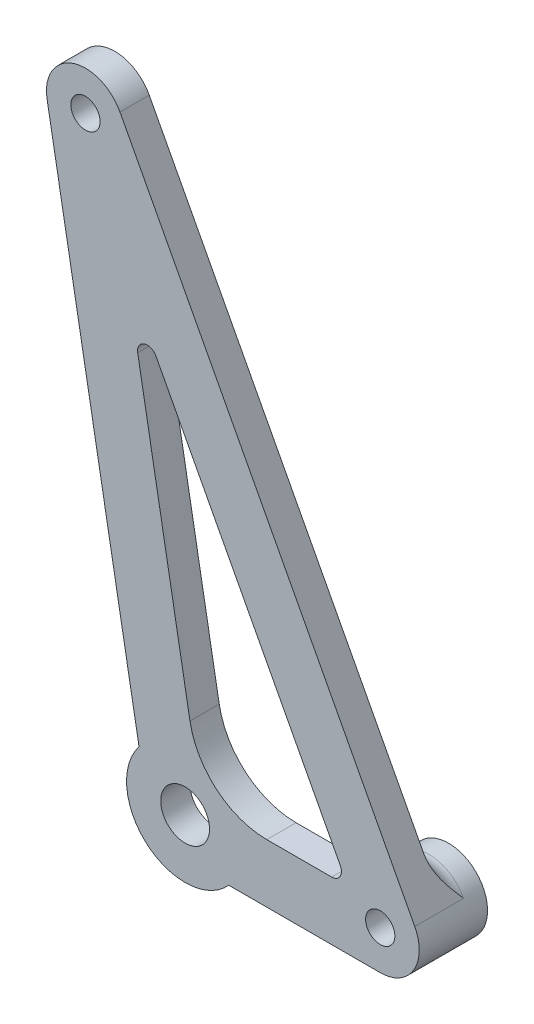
ISO-10303-21;
HEADER;
FILE_DESCRIPTION(('STEP AP214'),'2;1');
FILE_NAME('part.step','',(''),(''),'','','');
FILE_SCHEMA(('AUTOMOTIVE_DESIGN { 1 0 10303 214 1 1 1 1 }'));
ENDSEC;
DATA;
#1=APPLICATION_CONTEXT('core data for automotive mechanical design processes');
#2=APPLICATION_PROTOCOL_DEFINITION('international standard','automotive_design',2000,#1);
#3=PRODUCT_CONTEXT('',#1,'mechanical');
#4=PRODUCT('Part','Part','',(#3));
#5=PRODUCT_RELATED_PRODUCT_CATEGORY('part','',(#4));
#6=PRODUCT_DEFINITION_FORMATION('','',#4);
#7=PRODUCT_DEFINITION_CONTEXT('part definition',#1,'design');
#8=PRODUCT_DEFINITION('design','',#6,#7);
#9=PRODUCT_DEFINITION_SHAPE('','',#8);
#10=(LENGTH_UNIT() NAMED_UNIT(*) SI_UNIT(.MILLI.,.METRE.));
#11=(NAMED_UNIT(*) PLANE_ANGLE_UNIT() SI_UNIT($,.RADIAN.));
#12=(NAMED_UNIT(*) SI_UNIT($,.STERADIAN.) SOLID_ANGLE_UNIT());
#13=UNCERTAINTY_MEASURE_WITH_UNIT(LENGTH_MEASURE(1.E-05),#10,'distance_accuracy_value','');
#14=(GEOMETRIC_REPRESENTATION_CONTEXT(3) GLOBAL_UNCERTAINTY_ASSIGNED_CONTEXT((#13)) GLOBAL_UNIT_ASSIGNED_CONTEXT((#10,
#11,#12)) REPRESENTATION_CONTEXT('',''));
#15=CARTESIAN_POINT('',(0.,0.,0.));
#16=DIRECTION('',(0.,0.,1.));
#17=DIRECTION('',(1.,0.,0.));
#18=AXIS2_PLACEMENT_3D('',#15,#16,#17);
#19=CARTESIAN_POINT('',(0.,0.,0.));
#20=DIRECTION('',(0.,0.,1.));
#21=DIRECTION('',(1.,0.,0.));
#22=AXIS2_PLACEMENT_3D('',#19,#20,#21);
#23=PLANE('',#22);
#24=CARTESIAN_POINT('',(-27.7725616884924,57.1863652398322,0.));
#25=DIRECTION('',(0.,0.,1.));
#26=DIRECTION('',(1.,0.,0.));
#27=AXIS2_PLACEMENT_3D('',#24,#25,#26);
#28=CIRCLE('',#27,1.5);
#29=CARTESIAN_POINT('',(-26.2725616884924,57.1863652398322,0.));
#30=VERTEX_POINT('',#29);
#31=EDGE_CURVE('E442',#30,#30,#28,.T.);
#32=ORIENTED_EDGE('',*,*,#31,.T.);
#33=EDGE_LOOP('',(#32));
#34=FACE_BOUND('',#33,.T.);
#35=CARTESIAN_POINT('',(-17.5612440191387,0.,0.));
#36=DIRECTION('',(0.,0.,1.));
#37=DIRECTION('',(1.,0.,0.));
#38=AXIS2_PLACEMENT_3D('',#35,#36,#37);
#39=CIRCLE('',#38,2.5);
#40=CARTESIAN_POINT('',(-15.0612440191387,0.,0.));
#41=VERTEX_POINT('',#40);
#42=EDGE_CURVE('E445',#41,#41,#39,.T.);
#43=ORIENTED_EDGE('',*,*,#42,.T.);
#44=EDGE_LOOP('',(#43));
#45=FACE_BOUND('',#44,.T.);
#46=DIRECTION('',(-0.467116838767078,0.884195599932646,0.));
#47=VECTOR('',#46,1.);
#48=CARTESIAN_POINT('',(5.44340635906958,2.87572882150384,0.));
#49=LINE('',#48,#47);
#50=CARTESIAN_POINT('',(3.88652837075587,5.82271028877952,0.));
#51=VERTEX_POINT('',#50);
#52=CARTESIAN_POINT('',(-24.2357792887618,59.0548325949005,0.));
#53=VERTEX_POINT('',#52);
#54=EDGE_CURVE('E358',#51,#53,#49,.T.);
#55=ORIENTED_EDGE('',*,*,#54,.F.);
#56=CARTESIAN_POINT('',(2.43875598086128,0.,0.));
#57=DIRECTION('',(0.,0.,1.));
#58=DIRECTION('',(1.,0.,0.));
#59=AXIS2_PLACEMENT_3D('',#56,#57,#58);
#60=CIRCLE('',#59,6.);
#61=CARTESIAN_POINT('',(-1.97204709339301,4.06753195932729,0.));
#62=VERTEX_POINT('',#61);
#63=EDGE_CURVE('E350',#51,#62,#60,.T.);
#64=ORIENTED_EDGE('',*,*,#63,.T.);
#65=DIRECTION('',(-0.467116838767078,0.884195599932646,0.));
#66=VECTOR('',#65,1.);
#67=CARTESIAN_POINT('',(0.138232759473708,0.073027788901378,0.));
#68=LINE('',#67,#66);
#69=CARTESIAN_POINT('',(-20.5526836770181,39.2384265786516,0.));
#70=VERTEX_POINT('',#69);
#71=EDGE_CURVE('E451',#62,#70,#68,.T.);
#72=ORIENTED_EDGE('',*,*,#71,.T.);
#73=CARTESIAN_POINT('',(-21.4368792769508,38.7713097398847,0.));
#74=DIRECTION('',(0.,0.,1.));
#75=DIRECTION('',(1.,0.,0.));
#76=AXIS2_PLACEMENT_3D('',#73,#74,#75);
#77=CIRCLE('',#76,1.);
#78=CARTESIAN_POINT('',(-22.4213084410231,38.5955279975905,0.));
#79=VERTEX_POINT('',#78);
#80=EDGE_CURVE('E681',#79,#70,#77,.F.);
#81=ORIENTED_EDGE('',*,*,#80,.F.);
#82=DIRECTION('',(0.175781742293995,-0.9844291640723,0.));
#83=VECTOR('',#82,1.);
#84=CARTESIAN_POINT('',(-15.049756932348,-2.68731625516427,0.));
#85=LINE('',#84,#83);
#86=CARTESIAN_POINT('',(-17.0641271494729,8.59374606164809,0.));
#87=VERTEX_POINT('',#86);
#88=EDGE_CURVE('E682',#79,#87,#85,.T.);
#89=ORIENTED_EDGE('',*,*,#88,.T.);
#90=CARTESIAN_POINT('',(-9.18869383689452,10.,0.));
#91=DIRECTION('',(0.,0.,1.));
#92=DIRECTION('',(1.,0.,0.));
#93=AXIS2_PLACEMENT_3D('',#90,#91,#92);
#94=CIRCLE('',#93,8.);
#95=CARTESIAN_POINT('',(-9.18869383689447,2.,0.));
#96=VERTEX_POINT('',#95);
#97=EDGE_CURVE('E220',#96,#87,#94,.F.);
#98=ORIENTED_EDGE('',*,*,#97,.F.);
#99=DIRECTION('',(1.,0.,0.));
#100=VECTOR('',#99,1.);
#101=CARTESIAN_POINT('',(0.,2.,0.));
#102=LINE('',#101,#100);
#103=CARTESIAN_POINT('',(-3.2180982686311,2.,0.));
#104=VERTEX_POINT('',#103);
#105=EDGE_CURVE('E217',#96,#104,#102,.T.);
#106=ORIENTED_EDGE('',*,*,#105,.T.);
#107=CARTESIAN_POINT('',(2.43875598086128,0.,0.));
#108=DIRECTION('',(0.,0.,1.));
#109=DIRECTION('',(1.,0.,0.));
#110=AXIS2_PLACEMENT_3D('',#107,#108,#109);
#111=CIRCLE('',#110,6.);
#112=CARTESIAN_POINT('',(-2.0333799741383,-4.,0.));
#113=VERTEX_POINT('',#112);
#114=EDGE_CURVE('E68',#104,#113,#111,.T.);
#115=ORIENTED_EDGE('',*,*,#114,.T.);
#116=DIRECTION('',(1.,0.,0.));
#117=VECTOR('',#116,1.);
#118=CARTESIAN_POINT('',(0.,-4.,0.));
#119=LINE('',#118,#117);
#120=CARTESIAN_POINT('',(-13.0891080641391,-4.,0.));
#121=VERTEX_POINT('',#120);
#122=EDGE_CURVE('E449',#121,#113,#119,.T.);
#123=ORIENTED_EDGE('',*,*,#122,.F.);
#124=CARTESIAN_POINT('',(-17.5612440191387,0.,0.));
#125=DIRECTION('',(0.,0.,1.));
#126=DIRECTION('',(1.,0.,0.));
#127=AXIS2_PLACEMENT_3D('',#124,#125,#126);
#128=CIRCLE('',#127,6.);
#129=CARTESIAN_POINT('',(-22.2850805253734,3.69937409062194,0.));
#130=VERTEX_POINT('',#129);
#131=EDGE_CURVE('E178',#130,#121,#128,.T.);
#132=ORIENTED_EDGE('',*,*,#131,.F.);
#133=DIRECTION('',(0.175781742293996,-0.9844291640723,0.));
#134=VECTOR('',#133,1.);
#135=CARTESIAN_POINT('',(-20.9563319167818,-3.74200670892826,0.));
#136=LINE('',#135,#134);
#137=CARTESIAN_POINT('',(-31.7102783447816,56.4832382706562,0.));
#138=VERTEX_POINT('',#137);
#139=EDGE_CURVE('E459',#138,#130,#136,.T.);
#140=ORIENTED_EDGE('',*,*,#139,.F.);
#141=CARTESIAN_POINT('',(-27.7725616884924,57.1863652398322,0.));
#142=DIRECTION('',(0.,0.,1.));
#143=DIRECTION('',(1.,0.,0.));
#144=AXIS2_PLACEMENT_3D('',#141,#142,#143);
#145=CIRCLE('',#144,4.);
#146=EDGE_CURVE('E457',#53,#138,#145,.T.);
#147=ORIENTED_EDGE('',*,*,#146,.F.);
#148=EDGE_LOOP('',(#55,#64,#72,#81,#89,#98,#106,#115,#123,#132,#140,#147));
#149=FACE_BOUND('',#148,.T.);
#150=ADVANCED_FACE('F39',(#34,#45,#149),#23,.F.);
#151=CARTESIAN_POINT('',(0.,-4.,3.));
#152=DIRECTION('',(0.,1.,0.));
#153=DIRECTION('',(-1.,0.,0.));
#154=AXIS2_PLACEMENT_3D('',#151,#152,#153);
#155=PLANE('',#154);
#156=ORIENTED_EDGE('',*,*,#122,.T.);
#157=CARTESIAN_POINT('',(-2.0333799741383,-4.,0.));
#158=CARTESIAN_POINT('',(-1.9145876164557,-4.,-1.02440190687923E-05));
#159=CARTESIAN_POINT('',(-1.79593716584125,-4.,-0.00587622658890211));
#160=CARTESIAN_POINT('',(-1.5598429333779,-4.,-0.0280866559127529));
#161=CARTESIAN_POINT('',(-1.44239721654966,-4.,-0.044410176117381));
#162=CARTESIAN_POINT('',(-1.09644692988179,-4.,-0.106560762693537));
#163=CARTESIAN_POINT('',(-0.870307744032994,-4.,-0.165654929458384));
#164=CARTESIAN_POINT('',(-0.406324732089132,-4.,-0.318035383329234));
#165=CARTESIAN_POINT('',(-0.169414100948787,-4.,-0.414039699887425));
#166=CARTESIAN_POINT('',(0.29358888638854,-4.,-0.629574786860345));
#167=CARTESIAN_POINT('',(0.519664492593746,-4.,-0.749140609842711));
#168=CARTESIAN_POINT('',(0.964567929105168,-4.,-1.00514512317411));
#169=CARTESIAN_POINT('',(1.18331169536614,-4.,-1.14172666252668));
#170=CARTESIAN_POINT('',(1.6144491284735,-4.,-1.4241828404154));
#171=CARTESIAN_POINT('',(1.82684561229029,-3.99999999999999,-1.57005326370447));
#172=CARTESIAN_POINT('',(2.16845878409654,-4.00000000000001,-1.80889896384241));
#173=CARTESIAN_POINT('',(2.29844892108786,-4.00000000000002,-1.90078864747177));
#174=CARTESIAN_POINT('',(2.43187067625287,-4.,-1.99513135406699));
#175=CARTESIAN_POINT('',(2.43531332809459,-4.,-1.99756567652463));
#176=CARTESIAN_POINT('',(2.43875598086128,-4.,-2.));
#177=B_SPLINE_CURVE_WITH_KNOTS('',3,(#157,#158,#159,#160,#161,#162,#163,#164,#165,#166,#167,
#168,#169,#170,#171,#172,#173,#174,#175,#176),.UNSPECIFIED.,.F.,.F.,(4,2,2,2,2,2,2,2,2,4),(0.,
0.356013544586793,0.711316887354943,1.41000592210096,2.17516485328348,2.94147082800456,
3.71470886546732,4.48759847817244,4.96517109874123,4.97782020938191),.UNSPECIFIED.);
#178=CARTESIAN_POINT('',(2.43875598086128,-4.,-2.));
#179=VERTEX_POINT('',#178);
#180=EDGE_CURVE('E11',#113,#179,#177,.T.);
#181=ORIENTED_EDGE('',*,*,#180,.T.);
#182=DIRECTION('',(0.,0.,-1.));
#183=VECTOR('',#182,1.);
#184=CARTESIAN_POINT('',(2.43875598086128,-4.,3.));
#185=LINE('',#184,#183);
#186=CARTESIAN_POINT('',(2.43875598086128,-4.,3.));
#187=VERTEX_POINT('',#186);
#188=EDGE_CURVE('E484',#187,#179,#185,.T.);
#189=ORIENTED_EDGE('',*,*,#188,.F.);
#190=DIRECTION('',(1.,0.,0.));
#191=VECTOR('',#190,1.);
#192=CARTESIAN_POINT('',(0.,-4.,3.));
#193=LINE('',#192,#191);
#194=CARTESIAN_POINT('',(-13.0891080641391,-4.,3.));
#195=VERTEX_POINT('',#194);
#196=EDGE_CURVE('E203',#195,#187,#193,.T.);
#197=ORIENTED_EDGE('',*,*,#196,.F.);
#198=DIRECTION('',(0.,0.,-1.));
#199=VECTOR('',#198,1.);
#200=CARTESIAN_POINT('',(-13.0891080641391,-4.,3.));
#201=LINE('',#200,#199);
#202=EDGE_CURVE('E168',#195,#121,#201,.T.);
#203=ORIENTED_EDGE('',*,*,#202,.T.);
#204=EDGE_LOOP('',(#156,#181,#189,#197,#203));
#205=FACE_BOUND('',#204,.T.);
#206=ADVANCED_FACE('F380',(#205),#155,.F.);
#207=CARTESIAN_POINT('',(2.43875598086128,0.,3.));
#208=DIRECTION('',(0.,0.,-1.));
#209=DIRECTION('',(-1.,0.,0.));
#210=AXIS2_PLACEMENT_3D('',#207,#208,#209);
#211=CYLINDRICAL_SURFACE('',#210,4.);
#212=CARTESIAN_POINT('',(2.43875598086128,0.,-2.));
#213=DIRECTION('',(0.,0.,1.));
#214=DIRECTION('',(1.,0.,0.));
#215=AXIS2_PLACEMENT_3D('',#212,#213,#214);
#216=CIRCLE('',#215,4.);
#217=CARTESIAN_POINT('',(-0.501779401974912,2.71168797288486,-2.));
#218=VERTEX_POINT('',#217);
#219=CARTESIAN_POINT('',(5.97553838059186,1.86846735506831,-2.));
#220=VERTEX_POINT('',#219);
#221=EDGE_CURVE('E351',#218,#220,#216,.F.);
#222=ORIENTED_EDGE('',*,*,#221,.T.);
#223=DIRECTION('',(0.,0.,-1.));
#224=VECTOR('',#223,1.);
#225=CARTESIAN_POINT('',(5.97553838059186,1.86846735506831,3.));
#226=LINE('',#225,#224);
#227=CARTESIAN_POINT('',(5.97553838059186,1.86846735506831,3.));
#228=VERTEX_POINT('',#227);
#229=EDGE_CURVE('E473',#228,#220,#226,.T.);
#230=ORIENTED_EDGE('',*,*,#229,.F.);
#231=CARTESIAN_POINT('',(2.43875598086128,0.,3.));
#232=DIRECTION('',(0.,0.,1.));
#233=DIRECTION('',(1.,0.,0.));
#234=AXIS2_PLACEMENT_3D('',#231,#232,#233);
#235=CIRCLE('',#234,4.);
#236=EDGE_CURVE('E206',#187,#228,#235,.T.);
#237=ORIENTED_EDGE('',*,*,#236,.F.);
#238=ORIENTED_EDGE('',*,*,#188,.T.);
#239=CARTESIAN_POINT('',(2.43875598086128,0.,-2.));
#240=DIRECTION('',(0.,0.,1.));
#241=DIRECTION('',(1.,0.,0.));
#242=AXIS2_PLACEMENT_3D('',#239,#240,#241);
#243=CIRCLE('',#242,4.);
#244=CARTESIAN_POINT('',(-1.33248018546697,1.33333333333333,-2.));
#245=VERTEX_POINT('',#244);
#246=EDGE_CURVE('E488',#179,#245,#243,.F.);
#247=ORIENTED_EDGE('',*,*,#246,.T.);
#248=CARTESIAN_POINT('',(-1.4114859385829,1.08426803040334,-1.96479631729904));
#249=CARTESIAN_POINT('',(-1.30880827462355,1.44887699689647,0.104793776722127));
#250=CARTESIAN_POINT('',(-3.336606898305,2.,0.));
#251=CARTESIAN_POINT('',(-1.3952288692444,1.14210517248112,-1.9813215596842));
#252=CARTESIAN_POINT('',(-1.31222118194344,1.41541089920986,0.0862346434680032));
#253=CARTESIAN_POINT('',(-3.31222129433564,2.,0.));
#254=CARTESIAN_POINT('',(-1.37743548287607,1.20019069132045,-1.9919086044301));
#255=CARTESIAN_POINT('',(-1.31762594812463,1.38589893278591,0.0627961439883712));
#256=CARTESIAN_POINT('',(-3.28553121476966,2.,0.));
#257=CARTESIAN_POINT('',(-1.33913472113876,1.31574181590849,-2.00169609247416));
#258=CARTESIAN_POINT('',(-1.33014187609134,1.33777366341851,0.00982789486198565));
#259=CARTESIAN_POINT('',(-3.2280800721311,2.,0.));
#260=CARTESIAN_POINT('',(-1.31863407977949,1.3732085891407,-2.00092428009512));
#261=CARTESIAN_POINT('',(-1.33720541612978,1.31907717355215,-0.0195175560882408));
#262=CARTESIAN_POINT('',(-3.1973291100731,2.,0.));
#263=CARTESIAN_POINT('',(-1.26952533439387,1.50151010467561,-1.98694576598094));
#264=CARTESIAN_POINT('',(-1.35259457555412,1.29145150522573,-0.0885858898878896));
#265=CARTESIAN_POINT('',(-3.12366599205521,2.,0.));
#266=CARTESIAN_POINT('',(-1.2401978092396,1.57191853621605,-1.97054565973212));
#267=CARTESIAN_POINT('',(-1.36078876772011,1.28597010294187,-0.128976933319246));
#268=CARTESIAN_POINT('',(-3.0796747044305,2.,0.));
#269=CARTESIAN_POINT('',(-1.17856669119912,1.70898832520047,-1.92189513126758));
#270=CARTESIAN_POINT('',(-1.37271756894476,1.29459320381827,-0.206105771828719));
#271=CARTESIAN_POINT('',(-2.98722802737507,2.,0.));
#272=CARTESIAN_POINT('',(-1.14625784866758,1.77564272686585,-1.88961629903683));
#273=CARTESIAN_POINT('',(-1.37652849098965,1.30828248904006,-0.242817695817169));
#274=CARTESIAN_POINT('',(-2.93876476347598,2.,0.));
#275=CARTESIAN_POINT('',(-1.07607076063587,1.91113457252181,-1.80615495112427));
#276=CARTESIAN_POINT('',(-1.37781739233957,1.35333983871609,-0.310220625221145));
#277=CARTESIAN_POINT('',(-2.83348413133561,2.,0.));
#278=CARTESIAN_POINT('',(-1.0379723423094,1.97939345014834,-1.7532721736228));
#279=CARTESIAN_POINT('',(-1.37474199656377,1.38606555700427,-0.34013100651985));
#280=CARTESIAN_POINT('',(-2.77633650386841,2.,0.));
#281=CARTESIAN_POINT('',(-0.961169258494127,2.10859331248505,-1.63120129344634));
#282=CARTESIAN_POINT('',(-1.3605887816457,1.46283774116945,-0.383772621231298));
#283=CARTESIAN_POINT('',(-2.66113187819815,2.,0.));
#284=CARTESIAN_POINT('',(-0.922464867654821,2.16953750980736,-1.5620203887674));
#285=CARTESIAN_POINT('',(-1.34971681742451,1.50660098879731,-0.397930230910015));
#286=CARTESIAN_POINT('',(-2.60307529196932,2.,0.));
#287=CARTESIAN_POINT('',(-0.84284892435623,2.28836572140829,-1.40124094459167));
#288=CARTESIAN_POINT('',(-1.32058497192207,1.60209492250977,-0.4090059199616));
#289=CARTESIAN_POINT('',(-2.48365137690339,2.,0.));
#290=CARTESIAN_POINT('',(-0.802057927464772,2.34546395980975,-1.30817347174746));
#291=CARTESIAN_POINT('',(-1.30185732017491,1.65428627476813,-0.404778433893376));
#292=CARTESIAN_POINT('',(-2.42246488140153,2.,0.));
#293=CARTESIAN_POINT('',(-0.744462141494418,2.42242951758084,-1.15554985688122));
#294=CARTESIAN_POINT('',(-1.27140003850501,1.72986120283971,-0.38291007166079));
#295=CARTESIAN_POINT('',(-2.3360712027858,2.,0.));
#296=CARTESIAN_POINT('',(-0.725832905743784,2.44667210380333,-1.10240166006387));
#297=CARTESIAN_POINT('',(-1.26091624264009,1.75448388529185,-0.373141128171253));
#298=CARTESIAN_POINT('',(-2.3081273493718,2.,0.));
#299=CARTESIAN_POINT('',(-0.690289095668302,2.49196855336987,-0.99182896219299));
#300=CARTESIAN_POINT('',(-1.23993853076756,1.80170780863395,-0.348808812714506));
#301=CARTESIAN_POINT('',(-2.25481163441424,2.,0.));
#302=CARTESIAN_POINT('',(-0.673376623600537,2.51301852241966,-0.934399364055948));
#303=CARTESIAN_POINT('',(-1.22943200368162,1.82435532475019,-0.334272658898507));
#304=CARTESIAN_POINT('',(-2.22944292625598,2.,0.));
#305=CARTESIAN_POINT('',(-0.657589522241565,2.53231998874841,-0.874911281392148));
#306=CARTESIAN_POINT('',(-1.2192193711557,1.84559790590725,-0.317391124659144));
#307=CARTESIAN_POINT('',(-2.20576227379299,2.,0.));
#308=(BOUNDED_SURFACE() B_SPLINE_SURFACE(3,2,((#248,#249,#250),(#251,#252,#253),(#254,#255,
#256),(#257,#258,#259),(#260,#261,#262),(#263,#264,#265),(#266,#267,#268),(#269,#270,#271),
(#272,#273,#274),(#275,#276,#277),(#278,#279,#280),(#281,#282,#283),(#284,#285,#286),(#287,#288,
#289),(#290,#291,#292),(#293,#294,#295),(#296,#297,#298),(#299,#300,#301),(#302,#303,#304),
(#305,#306,#307)),.UNSPECIFIED.,.F.,.F.,.F.) B_SPLINE_SURFACE_WITH_KNOTS((4,2,2,2,2,2,2,2,2,4),
(3,3),(0.,0.274479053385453,0.548287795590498,0.893571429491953,1.23947509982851,
1.62376407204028,2.00788364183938,2.42702915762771,2.63733060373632,2.84788654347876),(0.,1.),
.UNSPECIFIED.) GEOMETRIC_REPRESENTATION_ITEM() RATIONAL_B_SPLINE_SURFACE(((1.,0.688972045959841,
1.),(1.,0.692241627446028,1.),(1.,0.696218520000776,1.),(1.,0.7053686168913,1.),(1.,
0.710538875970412,1.),(1.,0.723355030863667,1.),(1.,0.731294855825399,1.),(1.,0.748208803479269,
1.),(1.,0.757184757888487,1.),(1.,0.776628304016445,1.),(1.,0.787150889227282,1.),(1.,
0.808066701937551,1.),(1.,0.818459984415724,1.),(1.,0.839432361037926,1.),(1.,0.849941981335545,
1.),(1.,0.864464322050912,1.),(1.,0.86910503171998,1.),(1.,0.877869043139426,1.),(1.,
0.881991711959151,1.),(1.,0.885802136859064,1.))) REPRESENTATION_ITEM('') SURFACE());
#309=CARTESIAN_POINT('',(-1.4114859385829,1.08426803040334,-1.96479631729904));
#310=CARTESIAN_POINT('',(-1.3952288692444,1.14210517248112,-1.9813215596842));
#311=CARTESIAN_POINT('',(-1.37743548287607,1.20019069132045,-1.9919086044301));
#312=CARTESIAN_POINT('',(-1.33913472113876,1.31574181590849,-2.00169609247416));
#313=CARTESIAN_POINT('',(-1.31863407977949,1.3732085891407,-2.00092428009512));
#314=CARTESIAN_POINT('',(-1.26952533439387,1.50151010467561,-1.98694576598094));
#315=CARTESIAN_POINT('',(-1.2401978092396,1.57191853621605,-1.97054565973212));
#316=CARTESIAN_POINT('',(-1.17856669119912,1.70898832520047,-1.92189513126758));
#317=CARTESIAN_POINT('',(-1.14625784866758,1.77564272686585,-1.88961629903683));
#318=CARTESIAN_POINT('',(-1.07607076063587,1.91113457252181,-1.80615495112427));
#319=CARTESIAN_POINT('',(-1.0379723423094,1.97939345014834,-1.7532721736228));
#320=CARTESIAN_POINT('',(-0.961169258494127,2.10859331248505,-1.63120129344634));
#321=CARTESIAN_POINT('',(-0.922464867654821,2.16953750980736,-1.5620203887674));
#322=CARTESIAN_POINT('',(-0.842848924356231,2.28836572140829,-1.40124094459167));
#323=CARTESIAN_POINT('',(-0.802057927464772,2.34546395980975,-1.30817347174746));
#324=CARTESIAN_POINT('',(-0.744462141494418,2.42242951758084,-1.15554985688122));
#325=CARTESIAN_POINT('',(-0.725832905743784,2.44667210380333,-1.10240166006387));
#326=CARTESIAN_POINT('',(-0.690289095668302,2.49196855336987,-0.99182896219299));
#327=CARTESIAN_POINT('',(-0.673376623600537,2.51301852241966,-0.934399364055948));
#328=CARTESIAN_POINT('',(-0.657589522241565,2.53231998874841,-0.874911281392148));
#329=B_SPLINE_CURVE_WITH_KNOTS('',3,(#309,#310,#311,#312,#313,#314,#315,#316,#317,#318,#319,
#320,#321,#322,#323,#324,#325,#326,#327,#328),.UNSPECIFIED.,.F.,.F.,(4,2,2,2,2,2,2,2,2,4),(0.,
0.274479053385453,0.548287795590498,0.893571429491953,1.23947509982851,1.62376407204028,
2.00788364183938,2.42702915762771,2.63733060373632,2.84788654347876),.UNSPECIFIED.);
#330=CARTESIAN_POINT('',(-0.987165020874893,2.06471917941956,-1.67224943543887));
#331=VERTEX_POINT('',#330);
#332=EDGE_CURVE('E395',#245,#331,#329,.T.);
#333=ORIENTED_EDGE('',*,*,#332,.T.);
#334=CARTESIAN_POINT('',(-1.21454942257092,1.62891363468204,-1.04705856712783));
#335=CARTESIAN_POINT('',(-0.856804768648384,2.43125849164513,-0.360901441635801));
#336=CARTESIAN_POINT('',(-1.53451923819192,3.23934472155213,0.));
#337=CARTESIAN_POINT('',(-1.2035740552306,1.65353307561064,-1.09880356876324));
#338=CARTESIAN_POINT('',(-0.841783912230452,2.45036636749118,-0.372363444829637));
#339=CARTESIAN_POINT('',(-1.54617961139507,3.26141639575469,0.));
#340=CARTESIAN_POINT('',(-1.19171993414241,1.67944575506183,-1.14867235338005));
#341=CARTESIAN_POINT('',(-0.826043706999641,2.46975709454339,-0.381628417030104));
#342=CARTESIAN_POINT('',(-1.55835357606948,3.28446023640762,0.));
#343=CARTESIAN_POINT('',(-1.16625474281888,1.73343178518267,-1.24456702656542));
#344=CARTESIAN_POINT('',(-0.793513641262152,2.50844676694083,-0.395829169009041));
#345=CARTESIAN_POINT('',(-1.58346507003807,3.33199325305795,0.));
#346=CARTESIAN_POINT('',(-1.15264489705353,1.76150362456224,-1.29059555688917));
#347=CARTESIAN_POINT('',(-0.776698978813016,2.52776195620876,-0.400728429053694));
#348=CARTESIAN_POINT('',(-1.59640206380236,3.35648141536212,0.));
#349=CARTESIAN_POINT('',(-1.1091416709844,1.84840692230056,-1.4229386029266));
#350=CARTESIAN_POINT('',(-0.725090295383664,2.58468313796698,-0.408781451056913));
#351=CARTESIAN_POINT('',(-1.636003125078,3.4314414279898,0.));
#352=CARTESIAN_POINT('',(-1.07658691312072,1.90989758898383,-1.50345231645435));
#353=CARTESIAN_POINT('',(-0.689626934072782,2.62060491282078,-0.404877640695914));
#354=CARTESIAN_POINT('',(-1.66344360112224,3.4833829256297,0.));
#355=CARTESIAN_POINT('',(-1.0040230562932,2.03782833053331,-1.64875391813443));
#356=CARTESIAN_POINT('',(-0.621150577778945,2.68324689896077,-0.379641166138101));
#357=CARTESIAN_POINT('',(-1.71895109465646,3.58845188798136,0.));
#358=CARTESIAN_POINT('',(-0.96393704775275,2.10431479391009,-1.71336205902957));
#359=CARTESIAN_POINT('',(-0.588209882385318,2.7096355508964,-0.357636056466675));
#360=CARTESIAN_POINT('',(-1.74702167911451,3.64158610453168,0.));
#361=CARTESIAN_POINT('',(-0.876689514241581,2.23925686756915,-1.82430619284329));
#362=CARTESIAN_POINT('',(-0.531723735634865,2.74794472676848,-0.298777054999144));
#363=CARTESIAN_POINT('',(-1.80206700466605,3.74578023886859,0.));
#364=CARTESIAN_POINT('',(-0.829537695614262,2.3077096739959,-1.87066694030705));
#365=CARTESIAN_POINT('',(-0.508443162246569,2.75946762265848,-0.261535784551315));
#366=CARTESIAN_POINT('',(-1.82904318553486,3.7968428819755,0.));
#367=CARTESIAN_POINT('',(-0.726240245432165,2.44758130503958,-1.94493106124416));
#368=CARTESIAN_POINT('',(-0.477822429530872,2.76581113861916,-0.176451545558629));
#369=CARTESIAN_POINT('',(-1.88188944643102,3.89687445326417,0.));
#370=CARTESIAN_POINT('',(-0.66978785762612,2.51899662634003,-1.97192172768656));
#371=CARTESIAN_POINT('',(-0.471819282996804,2.7593286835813,-0.128120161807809));
#372=CARTESIAN_POINT('',(-1.90765695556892,3.94564922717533,0.));
#373=CARTESIAN_POINT('',(-0.580519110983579,2.62414275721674,-1.9941710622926));
#374=CARTESIAN_POINT('',(-0.480910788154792,2.73777986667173,-0.0575357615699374));
#375=CARTESIAN_POINT('',(-1.94358114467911,4.01364936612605,0.));
#376=CARTESIAN_POINT('',(-0.549898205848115,2.65896427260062,-1.99853334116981));
#377=CARTESIAN_POINT('',(-0.487145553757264,2.72844947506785,-0.034100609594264));
#378=CARTESIAN_POINT('',(-1.9551321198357,4.03551396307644,0.));
#379=CARTESIAN_POINT('',(-0.487390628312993,2.72760528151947,-2.00084488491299));
#380=CARTESIAN_POINT('',(-0.505843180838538,2.70675791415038,0.0105746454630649));
#381=CARTESIAN_POINT('',(-1.97719900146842,4.0772838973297,0.));
#382=CARTESIAN_POINT('',(-0.455502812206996,2.76142381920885,-1.99878821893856));
#383=CARTESIAN_POINT('',(-0.518365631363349,2.69437922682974,0.0317470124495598));
#384=CARTESIAN_POINT('',(-1.98771394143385,4.09718740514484,0.));
#385=CARTESIAN_POINT('',(-0.423121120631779,2.79457679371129,-1.99339548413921));
#386=CARTESIAN_POINT('',(-0.533884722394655,2.68114573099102,0.0508383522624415));
#387=CARTESIAN_POINT('',(-1.99765489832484,4.11600443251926,0.));
#388=(BOUNDED_SURFACE() B_SPLINE_SURFACE(3,2,((#334,#335,#336),(#337,#338,#339),(#340,#341,
#342),(#343,#344,#345),(#346,#347,#348),(#349,#350,#351),(#352,#353,#354),(#355,#356,#357),
(#358,#359,#360),(#361,#362,#363),(#364,#365,#366),(#367,#368,#369),(#370,#371,#372),(#373,#374,
#375),(#376,#377,#378),(#379,#380,#381),(#382,#383,#384),(#385,#386,#387)),.UNSPECIFIED.,.F.,
.F.,.F.) B_SPLINE_SURFACE_WITH_KNOTS((4,2,2,2,2,2,2,2,4),(3,3),(0.,0.196839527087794,
0.393542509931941,0.787169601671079,1.18505952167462,1.58240778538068,1.99743009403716,
2.20620788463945,2.41517863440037),(0.,1.),
.UNSPECIFIED.) GEOMETRIC_REPRESENTATION_ITEM() RATIONAL_B_SPLINE_SURFACE(((1.,0.873491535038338,
1.),(1.,0.86938949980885,1.),(1.,0.865062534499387,1.),(1.,0.8560398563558,1.),(1.,
0.851344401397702,1.),(1.,0.836812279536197,1.),(1.,0.826534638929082,1.),(1.,0.805352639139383,
1.),(1.,0.794442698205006,1.),(1.,0.77282750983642,1.),(1.,0.762122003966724,1.),(1.,
0.741253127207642,1.),(1.,0.731135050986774,1.),(1.,0.717500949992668,1.),(1.,0.713202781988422,
1.),(1.,0.705233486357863,1.),(1.,0.701562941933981,1.),(1.,0.698258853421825,1.))) REPRESENTATION_ITEM('') SURFACE());
#389=CARTESIAN_POINT('',(-1.21454942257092,1.62891363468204,-1.04705856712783));
#390=CARTESIAN_POINT('',(-1.2035740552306,1.65353307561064,-1.09880356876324));
#391=CARTESIAN_POINT('',(-1.19171993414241,1.67944575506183,-1.14867235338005));
#392=CARTESIAN_POINT('',(-1.16625474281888,1.73343178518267,-1.24456702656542));
#393=CARTESIAN_POINT('',(-1.15264489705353,1.76150362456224,-1.29059555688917));
#394=CARTESIAN_POINT('',(-1.1091416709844,1.84840692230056,-1.4229386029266));
#395=CARTESIAN_POINT('',(-1.07658691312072,1.90989758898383,-1.50345231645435));
#396=CARTESIAN_POINT('',(-1.0040230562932,2.03782833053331,-1.64875391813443));
#397=CARTESIAN_POINT('',(-0.96393704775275,2.10431479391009,-1.71336205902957));
#398=CARTESIAN_POINT('',(-0.876689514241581,2.23925686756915,-1.82430619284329));
#399=CARTESIAN_POINT('',(-0.829537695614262,2.3077096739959,-1.87066694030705));
#400=CARTESIAN_POINT('',(-0.726240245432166,2.44758130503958,-1.94493106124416));
#401=CARTESIAN_POINT('',(-0.66978785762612,2.51899662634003,-1.97192172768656));
#402=CARTESIAN_POINT('',(-0.580519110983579,2.62414275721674,-1.9941710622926));
#403=CARTESIAN_POINT('',(-0.549898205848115,2.65896427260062,-1.99853334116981));
#404=CARTESIAN_POINT('',(-0.487390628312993,2.72760528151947,-2.00084488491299));
#405=CARTESIAN_POINT('',(-0.455502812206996,2.76142381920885,-1.99878821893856));
#406=CARTESIAN_POINT('',(-0.423121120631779,2.79457679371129,-1.99339548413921));
#407=B_SPLINE_CURVE_WITH_KNOTS('',3,(#389,#390,#391,#392,#393,#394,#395,#396,#397,#398,#399,
#400,#401,#402,#403,#404,#405,#406),.UNSPECIFIED.,.F.,.F.,(4,2,2,2,2,2,2,2,4),(0.,
0.196839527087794,0.393542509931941,0.787169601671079,1.18505952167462,1.58240778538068,
1.99743009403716,2.20620788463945,2.41517863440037),.UNSPECIFIED.);
#408=EDGE_CURVE('E355',#331,#218,#407,.T.);
#409=ORIENTED_EDGE('',*,*,#408,.T.);
#410=EDGE_LOOP('',(#222,#230,#237,#238,#247,#333,#409));
#411=FACE_BOUND('',#410,.T.);
#412=CARTESIAN_POINT('',(2.43875598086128,0.,-4.));
#413=DIRECTION('',(0.,0.,-1.));
#414=DIRECTION('',(-1.,0.,0.));
#415=AXIS2_PLACEMENT_3D('',#412,#413,#414);
#416=CIRCLE('',#415,4.);
#417=CARTESIAN_POINT('',(-1.56124401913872,0.,-4.));
#418=VERTEX_POINT('',#417);
#419=EDGE_CURVE('E416',#418,#418,#416,.T.);
#420=ORIENTED_EDGE('',*,*,#419,.F.);
#421=EDGE_LOOP('',(#420));
#422=FACE_BOUND('',#421,.T.);
#423=ADVANCED_FACE('F376',(#411,#422),#211,.T.);
#424=CARTESIAN_POINT('',(5.44340635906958,2.87572882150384,3.));
#425=DIRECTION('',(-0.884195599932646,-0.467116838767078,0.));
#426=DIRECTION('',(0.467116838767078,-0.884195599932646,0.));
#427=AXIS2_PLACEMENT_3D('',#424,#425,#426);
#428=PLANE('',#427);
#429=ORIENTED_EDGE('',*,*,#229,.T.);
#430=CARTESIAN_POINT('',(3.88652837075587,5.82271028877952,0.));
#431=CARTESIAN_POINT('',(3.94201828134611,5.7176746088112,-1.02440190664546E-05));
#432=CARTESIAN_POINT('',(3.99744190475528,5.61276440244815,-0.00587622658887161));
#433=CARTESIAN_POINT('',(4.10772549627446,5.40401092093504,-0.0280866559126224));
#434=CARTESIAN_POINT('',(4.16258636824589,5.30016593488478,-0.0444101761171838));
#435=CARTESIAN_POINT('',(4.3241855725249,4.99427821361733,-0.106560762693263));
#436=CARTESIAN_POINT('',(4.4298189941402,4.794326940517,-0.165654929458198));
#437=CARTESIAN_POINT('',(4.64655327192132,4.38407520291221,-0.318035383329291));
#438=CARTESIAN_POINT('',(4.75721821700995,4.17459986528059,-0.414039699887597));
#439=CARTESIAN_POINT('',(4.9734947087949,3.76521466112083,-0.629574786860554));
#440=CARTESIAN_POINT('',(5.07909843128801,3.56531960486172,-0.749140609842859));
#441=CARTESIAN_POINT('',(5.28692031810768,3.17193794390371,-1.00514512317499));
#442=CARTESIAN_POINT('',(5.38909921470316,2.97852566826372,-1.14172666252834));
#443=CARTESIAN_POINT('',(5.590490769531,2.59731584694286,-1.42418284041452));
#444=CARTESIAN_POINT('',(5.68970474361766,2.40951581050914,-1.57005326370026));
#445=CARTESIAN_POINT('',(5.84927800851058,2.10746294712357,-1.80889896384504));
#446=CARTESIAN_POINT('',(5.90999859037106,1.99252623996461,-1.90078864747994));
#447=CARTESIAN_POINT('',(5.97232213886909,1.87455531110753,-1.99513135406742));
#448=CARTESIAN_POINT('',(5.97393025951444,1.87151133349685,-1.99756567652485));
#449=CARTESIAN_POINT('',(5.97553838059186,1.86846735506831,-2.));
#450=B_SPLINE_CURVE_WITH_KNOTS('',3,(#430,#431,#432,#433,#434,#435,#436,#437,#438,#439,#440,
#441,#442,#443,#444,#445,#446,#447,#448,#449),.UNSPECIFIED.,.F.,.F.,(4,2,2,2,2,2,2,2,2,4),(0.,
0.356013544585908,0.711316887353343,1.41000592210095,2.17516485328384,2.94147082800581,
3.71470886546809,4.48759847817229,4.96517109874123,4.97782020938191),.UNSPECIFIED.);
#451=EDGE_CURVE('E53',#220,#51,#450,.F.);
#452=ORIENTED_EDGE('',*,*,#451,.T.);
#453=ORIENTED_EDGE('',*,*,#54,.T.);
#454=DIRECTION('',(0.,0.,-1.));
#455=VECTOR('',#454,1.);
#456=CARTESIAN_POINT('',(-24.2357792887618,59.0548325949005,3.));
#457=LINE('',#456,#455);
#458=CARTESIAN_POINT('',(-24.2357792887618,59.0548325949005,3.));
#459=VERTEX_POINT('',#458);
#460=EDGE_CURVE('E470',#459,#53,#457,.T.);
#461=ORIENTED_EDGE('',*,*,#460,.F.);
#462=DIRECTION('',(-0.467116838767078,0.884195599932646,0.));
#463=VECTOR('',#462,1.);
#464=CARTESIAN_POINT('',(5.44340635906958,2.87572882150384,3.));
#465=LINE('',#464,#463);
#466=EDGE_CURVE('E208',#228,#459,#465,.T.);
#467=ORIENTED_EDGE('',*,*,#466,.F.);
#468=EDGE_LOOP('',(#429,#452,#453,#461,#467));
#469=FACE_BOUND('',#468,.T.);
#470=ADVANCED_FACE('F371',(#469),#428,.F.);
#471=CARTESIAN_POINT('',(-27.7725616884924,57.1863652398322,3.));
#472=DIRECTION('',(0.,0.,-1.));
#473=DIRECTION('',(-1.,0.,0.));
#474=AXIS2_PLACEMENT_3D('',#471,#472,#473);
#475=CYLINDRICAL_SURFACE('',#474,4.);
#476=ORIENTED_EDGE('',*,*,#146,.T.);
#477=DIRECTION('',(0.,0.,-1.));
#478=VECTOR('',#477,1.);
#479=CARTESIAN_POINT('',(-31.7102783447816,56.4832382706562,3.));
#480=LINE('',#479,#478);
#481=CARTESIAN_POINT('',(-31.7102783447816,56.4832382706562,3.));
#482=VERTEX_POINT('',#481);
#483=EDGE_CURVE('E467',#482,#138,#480,.T.);
#484=ORIENTED_EDGE('',*,*,#483,.F.);
#485=CARTESIAN_POINT('',(-27.7725616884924,57.1863652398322,3.));
#486=DIRECTION('',(0.,0.,1.));
#487=DIRECTION('',(1.,0.,0.));
#488=AXIS2_PLACEMENT_3D('',#485,#486,#487);
#489=CIRCLE('',#488,4.);
#490=EDGE_CURVE('E210',#459,#482,#489,.T.);
#491=ORIENTED_EDGE('',*,*,#490,.F.);
#492=ORIENTED_EDGE('',*,*,#460,.T.);
#493=EDGE_LOOP('',(#476,#484,#491,#492));
#494=FACE_BOUND('',#493,.T.);
#495=ADVANCED_FACE('F375',(#494),#475,.T.);
#496=CARTESIAN_POINT('',(-20.9563319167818,-3.74200670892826,3.));
#497=DIRECTION('',(0.9844291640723,0.175781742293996,0.));
#498=DIRECTION('',(-0.175781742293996,0.9844291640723,0.));
#499=AXIS2_PLACEMENT_3D('',#496,#497,#498);
#500=PLANE('',#499);
#501=ORIENTED_EDGE('',*,*,#139,.T.);
#502=DIRECTION('',(0.,0.,-1.));
#503=VECTOR('',#502,1.);
#504=CARTESIAN_POINT('',(-22.2850805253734,3.69937409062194,3.));
#505=LINE('',#504,#503);
#506=CARTESIAN_POINT('',(-22.2850805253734,3.69937409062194,3.));
#507=VERTEX_POINT('',#506);
#508=EDGE_CURVE('E464',#507,#130,#505,.T.);
#509=ORIENTED_EDGE('',*,*,#508,.F.);
#510=DIRECTION('',(0.175781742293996,-0.9844291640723,0.));
#511=VECTOR('',#510,1.);
#512=CARTESIAN_POINT('',(-20.9563319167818,-3.74200670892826,3.));
#513=LINE('',#512,#511);
#514=EDGE_CURVE('E212',#482,#507,#513,.T.);
#515=ORIENTED_EDGE('',*,*,#514,.F.);
#516=ORIENTED_EDGE('',*,*,#483,.T.);
#517=EDGE_LOOP('',(#501,#509,#515,#516));
#518=FACE_BOUND('',#517,.T.);
#519=ADVANCED_FACE('F624',(#518),#500,.F.);
#520=CARTESIAN_POINT('',(-2.53904589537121,3.,3.));
#521=DIRECTION('',(0.,0.,-1.));
#522=DIRECTION('',(-1.,0.,0.));
#523=AXIS2_PLACEMENT_3D('',#520,#521,#522);
#524=CYLINDRICAL_SURFACE('',#523,1.);
#525=CARTESIAN_POINT('',(-2.53904589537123,2.,0.));
#526=CARTESIAN_POINT('',(-2.36755366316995,2.,0.));
#527=CARTESIAN_POINT('',(-2.19643919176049,2.04501346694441,0.));
#528=CARTESIAN_POINT('',(-1.89796544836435,2.21361937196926,0.));
#529=CARTESIAN_POINT('',(-1.77103987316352,2.33701781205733,0.));
#530=CARTESIAN_POINT('',(-1.59409141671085,2.63062259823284,0.));
#531=CARTESIAN_POINT('',(-1.54427213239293,2.80049112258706,0.));
#532=CARTESIAN_POINT('',(-1.53461364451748,3.14315895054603,0.));
#533=CARTESIAN_POINT('',(-1.5747433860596,3.31548416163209,0.));
#534=CARTESIAN_POINT('',(-1.65485029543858,3.46711683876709,0.));
#535=B_SPLINE_CURVE_WITH_KNOTS('',3,(#525,#526,#527,#528,#529,#530,#531,#532,#533,#534),
.UNSPECIFIED.,.F.,.F.,(4,2,2,2,4),(0.,0.25,0.5,0.75,1.),.UNSPECIFIED.);
#536=CARTESIAN_POINT('',(-2.53904589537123,2.,0.));
#537=VERTEX_POINT('',#536);
#538=CARTESIAN_POINT('',(-1.65485029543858,3.46711683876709,0.));
#539=VERTEX_POINT('',#538);
#540=EDGE_CURVE('E163',#537,#539,#535,.T.);
#541=ORIENTED_EDGE('',*,*,#540,.F.);
#542=DIRECTION('',(0.,0.,-1.));
#543=VECTOR('',#542,1.);
#544=CARTESIAN_POINT('',(-2.53904589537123,2.,3.));
#545=LINE('',#544,#543);
#546=CARTESIAN_POINT('',(-2.53904589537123,2.,3.));
#547=VERTEX_POINT('',#546);
#548=EDGE_CURVE('E157',#547,#537,#545,.T.);
#549=ORIENTED_EDGE('',*,*,#548,.F.);
#550=CARTESIAN_POINT('',(-2.53904589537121,3.,3.));
#551=DIRECTION('',(0.,0.,1.));
#552=DIRECTION('',(1.,0.,0.));
#553=AXIS2_PLACEMENT_3D('',#550,#551,#552);
#554=CIRCLE('',#553,1.);
#555=CARTESIAN_POINT('',(-1.65485029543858,3.46711683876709,3.));
#556=VERTEX_POINT('',#555);
#557=EDGE_CURVE('E160',#547,#556,#554,.T.);
#558=ORIENTED_EDGE('',*,*,#557,.T.);
#559=DIRECTION('',(0.,0.,-1.));
#560=VECTOR('',#559,1.);
#561=CARTESIAN_POINT('',(-1.65485029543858,3.46711683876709,3.));
#562=LINE('',#561,#560);
#563=EDGE_CURVE('E216',#556,#539,#562,.T.);
#564=ORIENTED_EDGE('',*,*,#563,.T.);
#565=EDGE_LOOP('',(#541,#549,#558,#564));
#566=FACE_BOUND('',#565,.T.);
#567=ADVANCED_FACE('F159',(#566),#524,.F.);
#568=CARTESIAN_POINT('',(0.,2.,3.));
#569=DIRECTION('',(0.,1.,0.));
#570=DIRECTION('',(-1.,0.,0.));
#571=AXIS2_PLACEMENT_3D('',#568,#569,#570);
#572=PLANE('',#571);
#573=ORIENTED_EDGE('',*,*,#105,.F.);
#574=DIRECTION('',(0.,0.,-1.));
#575=VECTOR('',#574,1.);
#576=CARTESIAN_POINT('',(-9.18869383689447,2.,3.));
#577=LINE('',#576,#575);
#578=CARTESIAN_POINT('',(-9.18869383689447,2.,3.));
#579=VERTEX_POINT('',#578);
#580=EDGE_CURVE('E169',#579,#96,#577,.T.);
#581=ORIENTED_EDGE('',*,*,#580,.F.);
#582=DIRECTION('',(1.,0.,0.));
#583=VECTOR('',#582,1.);
#584=CARTESIAN_POINT('',(0.,2.,3.));
#585=LINE('',#584,#583);
#586=EDGE_CURVE('E175',#579,#547,#585,.T.);
#587=ORIENTED_EDGE('',*,*,#586,.T.);
#588=ORIENTED_EDGE('',*,*,#548,.T.);
#589=EDGE_CURVE('E221',#104,#537,#102,.T.);
#590=ORIENTED_EDGE('',*,*,#589,.F.);
#591=EDGE_LOOP('',(#573,#581,#587,#588,#590));
#592=FACE_BOUND('',#591,.T.);
#593=ADVANCED_FACE('F181',(#592),#572,.T.);
#594=CARTESIAN_POINT('',(-9.18869383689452,10.,3.));
#595=DIRECTION('',(0.,0.,-1.));
#596=DIRECTION('',(-1.,0.,0.));
#597=AXIS2_PLACEMENT_3D('',#594,#595,#596);
#598=CYLINDRICAL_SURFACE('',#597,8.);
#599=ORIENTED_EDGE('',*,*,#97,.T.);
#600=DIRECTION('',(0.,0.,-1.));
#601=VECTOR('',#600,1.);
#602=CARTESIAN_POINT('',(-17.0641271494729,8.59374606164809,3.));
#603=LINE('',#602,#601);
#604=CARTESIAN_POINT('',(-17.0641271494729,8.59374606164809,3.));
#605=VERTEX_POINT('',#604);
#606=EDGE_CURVE('E479',#605,#87,#603,.T.);
#607=ORIENTED_EDGE('',*,*,#606,.F.);
#608=CARTESIAN_POINT('',(-9.18869383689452,10.,3.));
#609=DIRECTION('',(0.,0.,1.));
#610=DIRECTION('',(1.,0.,0.));
#611=AXIS2_PLACEMENT_3D('',#608,#609,#610);
#612=CIRCLE('',#611,8.);
#613=EDGE_CURVE('E183',#579,#605,#612,.F.);
#614=ORIENTED_EDGE('',*,*,#613,.F.);
#615=ORIENTED_EDGE('',*,*,#580,.T.);
#616=EDGE_LOOP('',(#599,#607,#614,#615));
#617=FACE_BOUND('',#616,.T.);
#618=ADVANCED_FACE('F321',(#617),#598,.F.);
#619=CARTESIAN_POINT('',(-15.049756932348,-2.68731625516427,3.));
#620=DIRECTION('',(0.9844291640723,0.175781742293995,0.));
#621=DIRECTION('',(-0.175781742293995,0.9844291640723,0.));
#622=AXIS2_PLACEMENT_3D('',#619,#620,#621);
#623=PLANE('',#622);
#624=ORIENTED_EDGE('',*,*,#88,.F.);
#625=DIRECTION('',(0.,0.,-1.));
#626=VECTOR('',#625,1.);
#627=CARTESIAN_POINT('',(-22.4213084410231,38.5955279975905,3.));
#628=LINE('',#627,#626);
#629=CARTESIAN_POINT('',(-22.4213084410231,38.5955279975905,3.));
#630=VERTEX_POINT('',#629);
#631=EDGE_CURVE('E477',#630,#79,#628,.T.);
#632=ORIENTED_EDGE('',*,*,#631,.F.);
#633=DIRECTION('',(0.175781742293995,-0.9844291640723,0.));
#634=VECTOR('',#633,1.);
#635=CARTESIAN_POINT('',(-15.049756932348,-2.68731625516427,3.));
#636=LINE('',#635,#634);
#637=EDGE_CURVE('E185',#630,#605,#636,.T.);
#638=ORIENTED_EDGE('',*,*,#637,.T.);
#639=ORIENTED_EDGE('',*,*,#606,.T.);
#640=EDGE_LOOP('',(#624,#632,#638,#639));
#641=FACE_BOUND('',#640,.T.);
#642=ADVANCED_FACE('F317',(#641),#623,.T.);
#643=CARTESIAN_POINT('',(-21.4368792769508,38.7713097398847,3.));
#644=DIRECTION('',(0.,0.,-1.));
#645=DIRECTION('',(-1.,0.,0.));
#646=AXIS2_PLACEMENT_3D('',#643,#644,#645);
#647=CYLINDRICAL_SURFACE('',#646,1.);
#648=ORIENTED_EDGE('',*,*,#80,.T.);
#649=DIRECTION('',(0.,0.,-1.));
#650=VECTOR('',#649,1.);
#651=CARTESIAN_POINT('',(-20.5526836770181,39.2384265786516,3.));
#652=LINE('',#651,#650);
#653=CARTESIAN_POINT('',(-20.5526836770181,39.2384265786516,3.));
#654=VERTEX_POINT('',#653);
#655=EDGE_CURVE('E474',#654,#70,#652,.T.);
#656=ORIENTED_EDGE('',*,*,#655,.F.);
#657=CARTESIAN_POINT('',(-21.4368792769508,38.7713097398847,3.));
#658=DIRECTION('',(0.,0.,1.));
#659=DIRECTION('',(1.,0.,0.));
#660=AXIS2_PLACEMENT_3D('',#657,#658,#659);
#661=CIRCLE('',#660,1.);
#662=EDGE_CURVE('E191',#630,#654,#661,.F.);
#663=ORIENTED_EDGE('',*,*,#662,.F.);
#664=ORIENTED_EDGE('',*,*,#631,.T.);
#665=EDGE_LOOP('',(#648,#656,#663,#664));
#666=FACE_BOUND('',#665,.T.);
#667=ADVANCED_FACE('F313',(#666),#647,.F.);
#668=CARTESIAN_POINT('',(-27.7725616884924,57.1863652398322,3.));
#669=DIRECTION('',(0.,0.,-1.));
#670=DIRECTION('',(-1.,0.,0.));
#671=AXIS2_PLACEMENT_3D('',#668,#669,#670);
#672=CYLINDRICAL_SURFACE('',#671,1.5);
#673=CARTESIAN_POINT('',(-27.7725616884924,57.1863652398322,3.));
#674=DIRECTION('',(0.,0.,1.));
#675=DIRECTION('',(1.,0.,0.));
#676=AXIS2_PLACEMENT_3D('',#673,#674,#675);
#677=CIRCLE('',#676,1.5);
#678=CARTESIAN_POINT('',(-26.2725616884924,57.1863652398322,3.));
#679=VERTEX_POINT('',#678);
#680=EDGE_CURVE('E200',#679,#679,#677,.T.);
#681=ORIENTED_EDGE('',*,*,#680,.T.);
#682=EDGE_LOOP('',(#681));
#683=FACE_BOUND('',#682,.T.);
#684=ORIENTED_EDGE('',*,*,#31,.F.);
#685=EDGE_LOOP('',(#684));
#686=FACE_BOUND('',#685,.T.);
#687=ADVANCED_FACE('F316',(#683,#686),#672,.F.);
#688=CARTESIAN_POINT('',(2.43875598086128,0.,3.));
#689=DIRECTION('',(0.,0.,-1.));
#690=DIRECTION('',(-1.,0.,0.));
#691=AXIS2_PLACEMENT_3D('',#688,#689,#690);
#692=CYLINDRICAL_SURFACE('',#691,1.5);
#693=CARTESIAN_POINT('',(2.43875598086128,0.,3.));
#694=DIRECTION('',(0.,0.,1.));
#695=DIRECTION('',(1.,0.,0.));
#696=AXIS2_PLACEMENT_3D('',#693,#694,#695);
#697=CIRCLE('',#696,1.5);
#698=CARTESIAN_POINT('',(3.93875598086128,0.,3.));
#699=VERTEX_POINT('',#698);
#700=EDGE_CURVE('E197',#699,#699,#697,.T.);
#701=ORIENTED_EDGE('',*,*,#700,.T.);
#702=EDGE_LOOP('',(#701));
#703=FACE_BOUND('',#702,.T.);
#704=CARTESIAN_POINT('',(2.43875598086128,0.,-4.));
#705=DIRECTION('',(0.,0.,-1.));
#706=DIRECTION('',(-1.,0.,0.));
#707=AXIS2_PLACEMENT_3D('',#704,#705,#706);
#708=CIRCLE('',#707,1.5);
#709=CARTESIAN_POINT('',(0.938755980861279,0.,-4.));
#710=VERTEX_POINT('',#709);
#711=EDGE_CURVE('E413',#710,#710,#708,.T.);
#712=ORIENTED_EDGE('',*,*,#711,.T.);
#713=EDGE_LOOP('',(#712));
#714=FACE_BOUND('',#713,.T.);
#715=ADVANCED_FACE('F546',(#703,#714),#692,.F.);
#716=CARTESIAN_POINT('',(-17.5612440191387,0.,3.));
#717=DIRECTION('',(0.,0.,-1.));
#718=DIRECTION('',(-1.,0.,0.));
#719=AXIS2_PLACEMENT_3D('',#716,#717,#718);
#720=CYLINDRICAL_SURFACE('',#719,2.5);
#721=CARTESIAN_POINT('',(-17.5612440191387,0.,3.));
#722=DIRECTION('',(0.,0.,1.));
#723=DIRECTION('',(1.,0.,0.));
#724=AXIS2_PLACEMENT_3D('',#721,#722,#723);
#725=CIRCLE('',#724,2.5);
#726=CARTESIAN_POINT('',(-15.0612440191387,0.,3.));
#727=VERTEX_POINT('',#726);
#728=EDGE_CURVE('E194',#727,#727,#725,.T.);
#729=ORIENTED_EDGE('',*,*,#728,.T.);
#730=EDGE_LOOP('',(#729));
#731=FACE_BOUND('',#730,.T.);
#732=ORIENTED_EDGE('',*,*,#42,.F.);
#733=EDGE_LOOP('',(#732));
#734=FACE_BOUND('',#733,.T.);
#735=ADVANCED_FACE('F310',(#731,#734),#720,.F.);
#736=CARTESIAN_POINT('',(0.138232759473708,0.073027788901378,3.));
#737=DIRECTION('',(-0.884195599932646,-0.467116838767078,0.));
#738=DIRECTION('',(0.467116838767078,-0.884195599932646,0.));
#739=AXIS2_PLACEMENT_3D('',#736,#737,#738);
#740=PLANE('',#739);
#741=EDGE_CURVE('E447',#539,#62,#68,.T.);
#742=ORIENTED_EDGE('',*,*,#741,.F.);
#743=ORIENTED_EDGE('',*,*,#563,.F.);
#744=DIRECTION('',(-0.467116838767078,0.884195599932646,0.));
#745=VECTOR('',#744,1.);
#746=CARTESIAN_POINT('',(0.138232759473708,0.073027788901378,3.));
#747=LINE('',#746,#745);
#748=EDGE_CURVE('E177',#556,#654,#747,.T.);
#749=ORIENTED_EDGE('',*,*,#748,.T.);
#750=ORIENTED_EDGE('',*,*,#655,.T.);
#751=ORIENTED_EDGE('',*,*,#71,.F.);
#752=EDGE_LOOP('',(#742,#743,#749,#750,#751));
#753=FACE_BOUND('',#752,.T.);
#754=ADVANCED_FACE('F304',(#753),#740,.T.);
#755=CARTESIAN_POINT('',(-17.5612440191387,0.,3.));
#756=DIRECTION('',(0.,0.,-1.));
#757=DIRECTION('',(-1.,0.,0.));
#758=AXIS2_PLACEMENT_3D('',#755,#756,#757);
#759=CYLINDRICAL_SURFACE('',#758,6.);
#760=ORIENTED_EDGE('',*,*,#131,.T.);
#761=ORIENTED_EDGE('',*,*,#202,.F.);
#762=CARTESIAN_POINT('',(-17.5612440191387,0.,3.));
#763=DIRECTION('',(0.,0.,1.));
#764=DIRECTION('',(1.,0.,0.));
#765=AXIS2_PLACEMENT_3D('',#762,#763,#764);
#766=CIRCLE('',#765,6.);
#767=EDGE_CURVE('E214',#507,#195,#766,.T.);
#768=ORIENTED_EDGE('',*,*,#767,.F.);
#769=ORIENTED_EDGE('',*,*,#508,.T.);
#770=EDGE_LOOP('',(#760,#761,#768,#769));
#771=FACE_BOUND('',#770,.T.);
#772=ADVANCED_FACE('F309',(#771),#759,.T.);
#773=CARTESIAN_POINT('',(0.,0.,3.));
#774=DIRECTION('',(0.,0.,1.));
#775=DIRECTION('',(1.,0.,0.));
#776=AXIS2_PLACEMENT_3D('',#773,#774,#775);
#777=PLANE('',#776);
#778=ORIENTED_EDGE('',*,*,#557,.F.);
#779=ORIENTED_EDGE('',*,*,#586,.F.);
#780=ORIENTED_EDGE('',*,*,#613,.T.);
#781=ORIENTED_EDGE('',*,*,#637,.F.);
#782=ORIENTED_EDGE('',*,*,#662,.T.);
#783=ORIENTED_EDGE('',*,*,#748,.F.);
#784=EDGE_LOOP('',(#778,#779,#780,#781,#782,#783));
#785=FACE_BOUND('',#784,.T.);
#786=ORIENTED_EDGE('',*,*,#728,.F.);
#787=EDGE_LOOP('',(#786));
#788=FACE_BOUND('',#787,.T.);
#789=ORIENTED_EDGE('',*,*,#700,.F.);
#790=EDGE_LOOP('',(#789));
#791=FACE_BOUND('',#790,.T.);
#792=ORIENTED_EDGE('',*,*,#680,.F.);
#793=EDGE_LOOP('',(#792));
#794=FACE_BOUND('',#793,.T.);
#795=ORIENTED_EDGE('',*,*,#196,.T.);
#796=ORIENTED_EDGE('',*,*,#236,.T.);
#797=ORIENTED_EDGE('',*,*,#466,.T.);
#798=ORIENTED_EDGE('',*,*,#490,.T.);
#799=ORIENTED_EDGE('',*,*,#514,.T.);
#800=ORIENTED_EDGE('',*,*,#767,.T.);
#801=EDGE_LOOP('',(#795,#796,#797,#798,#799,#800));
#802=FACE_BOUND('',#801,.T.);
#803=ADVANCED_FACE('F173',(#785,#788,#791,#794,#802),#777,.T.);
#804=CARTESIAN_POINT('',(2.43875598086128,0.,-4.));
#805=DIRECTION('',(0.,0.,-1.));
#806=DIRECTION('',(-1.,0.,0.));
#807=AXIS2_PLACEMENT_3D('',#804,#805,#806);
#808=PLANE('',#807);
#809=ORIENTED_EDGE('',*,*,#419,.T.);
#810=EDGE_LOOP('',(#809));
#811=FACE_BOUND('',#810,.T.);
#812=ORIENTED_EDGE('',*,*,#711,.F.);
#813=EDGE_LOOP('',(#812));
#814=FACE_BOUND('',#813,.T.);
#815=ADVANCED_FACE('F423',(#811,#814),#808,.T.);
#816=CARTESIAN_POINT('',(2.43875598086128,0.,-2.));
#817=DIRECTION('',(0.,0.,1.));
#818=DIRECTION('',(1.,0.,0.));
#819=AXIS2_PLACEMENT_3D('',#816,#817,#818);
#820=TOROIDAL_SURFACE('',#819,6.,2.);
#821=ORIENTED_EDGE('',*,*,#451,.F.);
#822=ORIENTED_EDGE('',*,*,#221,.F.);
#823=CARTESIAN_POINT('',(-1.97204709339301,4.06753195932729,-2.));
#824=DIRECTION('',(0.677921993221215,0.735133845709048,0.));
#825=DIRECTION('',(-0.735133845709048,0.677921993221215,0.));
#826=AXIS2_PLACEMENT_3D('',#823,#824,#825);
#827=CIRCLE('',#826,2.);
#828=EDGE_CURVE('E411',#62,#218,#827,.T.);
#829=ORIENTED_EDGE('',*,*,#828,.F.);
#830=ORIENTED_EDGE('',*,*,#63,.F.);
#831=EDGE_LOOP('',(#821,#822,#829,#830));
#832=FACE_BOUND('',#831,.T.);
#833=ADVANCED_FACE('F369',(#832),#820,.F.);
#834=CARTESIAN_POINT('',(-1.65485029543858,3.46711683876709,0.));
#835=CARTESIAN_POINT('',(-1.63055161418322,3.44609167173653,-0.0106705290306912));
#836=CARTESIAN_POINT('',(-1.60671904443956,3.42490567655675,-0.0220797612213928));
#837=CARTESIAN_POINT('',(-1.5599926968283,3.38223846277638,-0.0463380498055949));
#838=CARTESIAN_POINT('',(-1.537100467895,3.36075682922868,-0.0591893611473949));
#839=CARTESIAN_POINT('',(-1.49233263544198,3.31758597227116,-0.0862637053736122));
#840=CARTESIAN_POINT('',(-1.47045731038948,3.29589669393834,-0.100487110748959));
#841=CARTESIAN_POINT('',(-1.4278022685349,3.25239707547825,-0.130240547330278));
#842=CARTESIAN_POINT('',(-1.40702134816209,3.23058689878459,-0.14576909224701));
#843=CARTESIAN_POINT('',(-1.36663222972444,3.18693249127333,-0.178065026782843));
#844=CARTESIAN_POINT('',(-1.34702115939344,3.16508849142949,-0.194829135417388));
#845=CARTESIAN_POINT('',(-1.30905649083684,3.12145349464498,-0.229536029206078));
#846=CARTESIAN_POINT('',(-1.29069815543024,3.0996626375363,-0.247473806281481));
#847=CARTESIAN_POINT('',(-1.25526352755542,3.05618089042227,-0.284474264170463));
#848=CARTESIAN_POINT('',(-1.23818286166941,3.03448992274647,-0.303532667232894));
#849=CARTESIAN_POINT('',(-1.20527052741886,2.99119570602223,-0.342761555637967));
#850=CARTESIAN_POINT('',(-1.18943816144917,2.96959241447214,-0.362931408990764));
#851=CARTESIAN_POINT('',(-1.1590215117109,2.92647302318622,-0.404383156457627));
#852=CARTESIAN_POINT('',(-1.14443970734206,2.90495717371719,-0.425667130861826));
#853=CARTESIAN_POINT('',(-1.11652650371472,2.86199402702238,-0.469380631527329));
#854=CARTESIAN_POINT('',(-1.10320229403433,2.84054772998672,-0.491815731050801));
#855=CARTESIAN_POINT('',(-1.07786977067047,2.79782373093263,-0.53773018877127));
#856=CARTESIAN_POINT('',(-1.06586587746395,2.77654680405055,-0.561212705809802));
#857=CARTESIAN_POINT('',(-1.04328412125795,2.73434174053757,-0.609031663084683));
#858=CARTESIAN_POINT('',(-1.03270254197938,2.71341282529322,-0.633365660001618));
#859=CARTESIAN_POINT('',(-1.01302534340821,2.67201305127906,-0.682765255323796));
#860=CARTESIAN_POINT('',(-1.00392214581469,2.65154035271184,-0.707826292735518));
#861=CARTESIAN_POINT('',(-0.987169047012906,2.61103673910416,-0.758674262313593));
#862=CARTESIAN_POINT('',(-0.979515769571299,2.59100489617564,-0.784459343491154));
#863=CARTESIAN_POINT('',(-0.965656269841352,2.55138091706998,-0.836752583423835));
#864=CARTESIAN_POINT('',(-0.959450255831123,2.53178884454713,-0.863260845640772));
#865=CARTESIAN_POINT('',(-0.948483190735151,2.49301584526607,-0.917046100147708));
#866=CARTESIAN_POINT('',(-0.943728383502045,2.47383701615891,-0.944325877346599));
#867=CARTESIAN_POINT('',(-0.935683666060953,2.43594083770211,-0.999590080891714));
#868=CARTESIAN_POINT('',(-0.93240007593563,2.41722579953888,-1.02757701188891));
#869=CARTESIAN_POINT('',(-0.927339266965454,2.38037933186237,-1.08409309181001));
#870=CARTESIAN_POINT('',(-0.925563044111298,2.36224829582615,-1.11262258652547));
#871=CARTESIAN_POINT('',(-0.923524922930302,2.32669321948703,-1.17002547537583));
#872=CARTESIAN_POINT('',(-0.923257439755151,2.30926680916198,-1.19889720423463));
#873=CARTESIAN_POINT('',(-0.924217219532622,2.27516273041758,-1.25689501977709));
#874=CARTESIAN_POINT('',(-0.925438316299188,2.25848226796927,-1.28601956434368));
#875=CARTESIAN_POINT('',(-0.929384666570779,2.22587527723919,-1.34452381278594));
#876=CARTESIAN_POINT('',(-0.932107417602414,2.2099475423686,-1.37390301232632));
#877=CARTESIAN_POINT('',(-0.939055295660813,2.1788460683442,-1.43291467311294));
#878=CARTESIAN_POINT('',(-0.943281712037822,2.16367298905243,-1.46254733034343));
#879=CARTESIAN_POINT('',(-0.953238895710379,2.13408255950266,-1.52206499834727));
#880=CARTESIAN_POINT('',(-0.958974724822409,2.11966795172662,-1.55195052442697));
#881=CARTESIAN_POINT('',(-0.971948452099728,2.09159310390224,-1.61197390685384));
#882=CARTESIAN_POINT('',(-0.979195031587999,2.07793782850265,-1.64211221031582));
#883=CARTESIAN_POINT('',(-0.987165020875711,2.06471917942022,-1.67224943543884));
#884=B_SPLINE_CURVE_WITH_KNOTS('',3,(#834,#835,#836,#837,#838,#839,#840,#841,#842,#843,#844,
#845,#846,#847,#848,#849,#850,#851,#852,#853,#854,#855,#856,#857,#858,#859,#860,#861,#862,#863,
#864,#865,#866,#867,#868,#869,#870,#871,#872,#873,#874,#875,#876,#877,#878,#879,#880,#881,#882,
#883),.UNSPECIFIED.,.F.,.F.,(4,2,2,2,2,2,2,2,2,2,2,2,2,2,2,2,2,2,2,2,2,2,2,2,4),(0.,
0.101558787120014,0.203278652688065,0.305026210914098,0.406659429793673,0.508031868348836,
0.608996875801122,0.709598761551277,0.810144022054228,0.910884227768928,1.01216930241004,
1.11378377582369,1.215127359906,1.31593382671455,1.41650259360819,1.51708582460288,
1.6180959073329,1.71953584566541,1.82104275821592,1.92217367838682,2.02288710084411,
2.12343319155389,2.2240657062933,2.32504009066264,2.42661154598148),.UNSPECIFIED.);
#885=EDGE_CURVE('E280',#539,#331,#884,.T.);
#886=ORIENTED_EDGE('',*,*,#885,.F.);
#887=ORIENTED_EDGE('',*,*,#741,.T.);
#888=ORIENTED_EDGE('',*,*,#828,.T.);
#889=ORIENTED_EDGE('',*,*,#408,.F.);
#890=EDGE_LOOP('',(#886,#887,#888,#889));
#891=FACE_BOUND('',#890,.T.);
#892=ADVANCED_FACE('F247',(#891),#388,.F.);
#893=CARTESIAN_POINT('',(-0.987165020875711,2.06471917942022,-1.67224943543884));
#894=CARTESIAN_POINT('',(-0.987165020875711,2.06471917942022,-1.67224943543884));
#895=CARTESIAN_POINT('',(-0.987165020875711,2.06471917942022,-1.67224943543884));
#896=CARTESIAN_POINT('',(-0.987165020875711,2.06471917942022,-1.67224943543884));
#897=CARTESIAN_POINT('',(-0.987165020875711,2.06471917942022,-1.67224943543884));
#898=CARTESIAN_POINT('',(-0.987165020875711,2.06471917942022,-1.67224943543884));
#899=CARTESIAN_POINT('',(-0.987165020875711,2.06471917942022,-1.67224943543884));
#900=CARTESIAN_POINT('',(-0.987165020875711,2.06471917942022,-1.67224943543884));
#901=CARTESIAN_POINT('',(-0.987165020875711,2.06471917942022,-1.67224943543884));
#902=CARTESIAN_POINT('',(-0.987165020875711,2.06471917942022,-1.67224943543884));
#903=CARTESIAN_POINT('',(-0.999161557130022,2.04481371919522,-1.62687214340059));
#904=CARTESIAN_POINT('',(-0.99758143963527,2.0474355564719,-1.6288540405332));
#905=CARTESIAN_POINT('',(-0.995686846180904,2.05057919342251,-1.6303404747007));
#906=CARTESIAN_POINT('',(-0.991583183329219,2.05738826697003,-1.63232240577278));
#907=CARTESIAN_POINT('',(-0.9893741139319,2.06105370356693,-1.63281790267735));
#908=CARTESIAN_POINT('',(-0.984955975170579,2.06838457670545,-1.63281794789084));
#909=CARTESIAN_POINT('',(-0.982746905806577,2.07205001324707,-1.63232249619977));
#910=CARTESIAN_POINT('',(-0.978643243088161,2.07885908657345,-1.63034063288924));
#911=CARTESIAN_POINT('',(-0.976748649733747,2.08200272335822,-1.6288542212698));
#912=CARTESIAN_POINT('',(-0.975168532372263,2.08462456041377,-1.62687232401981));
#913=CARTESIAN_POINT('',(-1.01271250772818,2.02601484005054,-1.58177875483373));
#914=CARTESIAN_POINT('',(-1.00928061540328,2.03122735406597,-1.58568426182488));
#915=CARTESIAN_POINT('',(-1.00528699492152,2.03739280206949,-1.5886134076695));
#916=CARTESIAN_POINT('',(-0.996837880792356,2.05076580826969,-1.59251896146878));
#917=CARTESIAN_POINT('',(-0.992384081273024,2.05797260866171,-1.59349536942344));
#918=CARTESIAN_POINT('',(-0.98363770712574,2.07248517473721,-1.59349543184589));
#919=CARTESIAN_POINT('',(-0.979345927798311,2.07978962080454,-1.59251908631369));
#920=CARTESIAN_POINT('',(-0.971468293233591,2.09350704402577,-1.58861362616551));
#921=CARTESIAN_POINT('',(-0.967882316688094,2.09991816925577,-1.58568451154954));
#922=CARTESIAN_POINT('',(-0.964876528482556,2.10538748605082,-1.58177900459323));
#923=CARTESIAN_POINT('',(-1.04290766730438,1.99062143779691,-1.49216075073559));
#924=CARTESIAN_POINT('',(-1.03551325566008,2.00049675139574,-1.50000753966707));
#925=CARTESIAN_POINT('',(-1.0269971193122,2.012358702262,-1.5058926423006));
#926=CARTESIAN_POINT('',(-1.00932902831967,2.03849981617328,-1.51373946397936));
#927=CARTESIAN_POINT('',(-1.00018512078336,2.05277537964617,-1.51570118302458));
#928=CARTESIAN_POINT('',(-0.982686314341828,2.08181056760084,-1.51570122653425));
#929=CARTESIAN_POINT('',(-0.974335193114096,2.09656392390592,-1.5137395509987));
#930=CARTESIAN_POINT('',(-0.959474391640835,2.12439692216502,-1.50589279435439));
#931=CARTESIAN_POINT('',(-0.952964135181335,2.13746776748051,-1.50000771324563));
#932=CARTESIAN_POINT('',(-0.947686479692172,2.1486187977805,-1.49216092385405));
#933=CARTESIAN_POINT('',(-1.05955187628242,1.97402691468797,-1.44763613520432));
#934=CARTESIAN_POINT('',(-1.05009198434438,1.98590133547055,-1.45754471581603));
#935=CARTESIAN_POINT('',(-1.03916413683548,2.00042000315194,-1.4649761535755));
#936=CARTESIAN_POINT('',(-1.01661235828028,2.03278424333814,-1.47488474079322));
#937=CARTESIAN_POINT('',(-1.0050011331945,2.05062413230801,-1.47736189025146));
#938=CARTESIAN_POINT('',(-0.983033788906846,2.08707382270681,-1.47736189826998));
#939=CARTESIAN_POINT('',(-0.972683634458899,2.10567372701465,-1.47488475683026));
#940=CARTESIAN_POINT('',(-0.954601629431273,2.14073178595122,-1.46497618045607));
#941=CARTESIAN_POINT('',(-0.94686886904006,2.15717605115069,-1.45754474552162));
#942=CARTESIAN_POINT('',(-0.940788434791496,2.17108718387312,-1.44763616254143));
#943=CARTESIAN_POINT('',(-1.1141010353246,1.92753667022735,-1.31491689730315));
#944=CARTESIAN_POINT('',(-1.09795339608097,1.94483226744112,-1.33094175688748));
#945=CARTESIAN_POINT('',(-1.07929968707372,1.96686772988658,-1.34296035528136));
#946=CARTESIAN_POINT('',(-1.04137457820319,2.01733852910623,-1.35898507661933));
#947=CARTESIAN_POINT('',(-1.02213367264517,2.04576022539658,-1.3629911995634));
#948=CARTESIAN_POINT('',(-0.986735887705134,2.104494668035,-1.3629910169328));
#949=CARTESIAN_POINT('',(-0.970593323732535,2.13478366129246,-1.35898471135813));
#950=CARTESIAN_POINT('',(-0.943682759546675,2.19189266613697,-1.3429597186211));
#951=CARTESIAN_POINT('',(-0.932912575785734,2.21867934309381,-1.33094103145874));
#952=CARTESIAN_POINT('',(-0.925162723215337,2.2410360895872,-1.31491617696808));
#953=CARTESIAN_POINT('',(-1.15662251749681,1.9009342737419,-1.22757688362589));
#954=CARTESIAN_POINT('',(-1.13508027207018,1.92153690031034,-1.24731487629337));
#955=CARTESIAN_POINT('',(-1.11055028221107,1.9480936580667,-1.26211825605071));
#956=CARTESIAN_POINT('',(-1.06148066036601,2.00976803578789,-1.28185591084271));
#957=CARTESIAN_POINT('',(-1.03698846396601,2.04486443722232,-1.28679018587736));
#958=CARTESIAN_POINT('',(-0.992882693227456,2.11804786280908,-1.28678975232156));
#959=CARTESIAN_POINT('',(-0.973291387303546,2.15609793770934,-1.28185504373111));
#960=CARTESIAN_POINT('',(-0.941680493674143,2.22829437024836,-1.26211676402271));
#961=CARTESIAN_POINT('',(-0.929657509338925,2.26238887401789,-1.24731319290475));
#962=CARTESIAN_POINT('',(-0.921503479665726,2.29106035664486,-1.22757525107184));
#963=CARTESIAN_POINT('',(-1.2538516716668,1.85644123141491,-1.0551835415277));
#964=CARTESIAN_POINT('',(-1.21895681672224,1.88413408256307,-1.08037818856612));
#965=CARTESIAN_POINT('',(-1.18111656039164,1.91908685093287,-1.09927387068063));
#966=CARTESIAN_POINT('',(-1.10825204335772,2.00123238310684,-1.12446762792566));
#967=CARTESIAN_POINT('',(-1.07331587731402,2.04838574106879,-1.13076570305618));
#968=CARTESIAN_POINT('',(-1.01296511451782,2.14852448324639,-1.13076456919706));
#969=CARTESIAN_POINT('',(-0.98759187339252,2.20144124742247,-1.12446536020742));
#970=CARTESIAN_POINT('',(-0.94899579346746,2.30423978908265,-1.09926998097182));
#971=CARTESIAN_POINT('',(-0.93576664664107,2.3540252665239,-1.08037381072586));
#972=CARTESIAN_POINT('',(-0.927580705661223,2.39781518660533,-1.05517932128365));
#973=CARTESIAN_POINT('',(-1.3084925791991,1.83883471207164,-0.970672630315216));
#974=CARTESIAN_POINT('',(-1.26574322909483,1.87015159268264,-0.997714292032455));
#975=CARTESIAN_POINT('',(-1.22051554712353,1.90891105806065,-1.01799542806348));
#976=CARTESIAN_POINT('',(-1.13503542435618,2.00027842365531,-1.04503677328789));
#977=CARTESIAN_POINT('',(-1.09489479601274,2.05283630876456,-1.05179698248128));
#978=CARTESIAN_POINT('',(-1.02698066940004,2.16552422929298,-1.05179659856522));
#979=CARTESIAN_POINT('',(-0.999259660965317,2.22556717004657,-1.04503600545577));
#980=CARTESIAN_POINT('',(-0.958402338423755,2.34382782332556,-1.01799414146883));
#981=CARTESIAN_POINT('',(-0.945258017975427,2.4019233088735,-0.997712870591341));
#982=CARTESIAN_POINT('',(-0.937536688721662,2.45435093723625,-0.970671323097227));
#983=CARTESIAN_POINT('',(-1.426583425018,1.81363787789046,-0.80952244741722));
#984=CARTESIAN_POINT('',(-1.36654692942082,1.85149897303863,-0.838489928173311));
#985=CARTESIAN_POINT('',(-1.30559683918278,1.89675326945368,-0.86021546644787));
#986=CARTESIAN_POINT('',(-1.19408138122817,2.00424792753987,-0.88918274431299));
#987=CARTESIAN_POINT('',(-1.14367864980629,2.06641553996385,-0.89642448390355));
#988=CARTESIAN_POINT('',(-1.06177525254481,2.20231532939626,-0.896424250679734));
#989=CARTESIAN_POINT('',(-1.03035093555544,2.27592082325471,-0.889182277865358));
#990=CARTESIAN_POINT('',(-0.987395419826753,2.42473510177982,-0.860214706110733));
#991=CARTESIAN_POINT('',(-0.975852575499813,2.49976610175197,-0.838489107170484));
#992=CARTESIAN_POINT('',(-0.970419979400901,2.5705358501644,-0.809521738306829));
#993=CARTESIAN_POINT('',(-1.49040642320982,1.80585942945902,-0.732192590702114));
#994=CARTESIAN_POINT('',(-1.42093727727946,1.84664070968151,-0.761238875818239));
#995=CARTESIAN_POINT('',(-1.35162938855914,1.8946209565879,-0.783023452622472));
#996=CARTESIAN_POINT('',(-1.22662575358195,2.00913452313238,-0.81206934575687));
#997=CARTESIAN_POINT('',(-1.17111974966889,2.07558296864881,-0.819330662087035));
#998=CARTESIAN_POINT('',(-1.08269918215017,2.22229671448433,-0.819330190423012));
#999=CARTESIAN_POINT('',(-1.0498736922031,2.30241421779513,-0.812068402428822));
#1000=CARTESIAN_POINT('',(-1.00701277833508,2.46643345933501,-0.783021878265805));
#1001=CARTESIAN_POINT('',(-0.996963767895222,2.55012778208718,-0.761237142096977));
#1002=CARTESIAN_POINT('',(-0.993355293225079,2.63060194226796,-0.732191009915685));
#1003=CARTESIAN_POINT('',(-1.62768549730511,1.80002108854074,-0.584076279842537));
#1004=CARTESIAN_POINT('',(-1.53855112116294,1.84507721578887,-0.611506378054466));
#1005=CARTESIAN_POINT('',(-1.45190453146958,1.89737382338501,-0.632078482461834));
#1006=CARTESIAN_POINT('',(-1.29917488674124,2.02427685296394,-0.659507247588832));
#1007=CARTESIAN_POINT('',(-1.23333578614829,2.09877415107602,-0.666363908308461));
#1008=CARTESIAN_POINT('',(-1.13226722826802,2.26647567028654,-0.666362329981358));
#1009=CARTESIAN_POINT('',(-1.09715229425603,2.35948986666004,-0.659504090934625));
#1010=CARTESIAN_POINT('',(-1.05628874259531,2.55381263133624,-0.632073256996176));
#1011=CARTESIAN_POINT('',(-1.05052265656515,2.65485452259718,-0.611500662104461));
#1012=CARTESIAN_POINT('',(-1.05232030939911,2.75471393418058,-0.584071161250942));
#1013=CARTESIAN_POINT('',(-1.70163779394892,1.80206868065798,-0.512969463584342));
#1014=CARTESIAN_POINT('',(-1.60229492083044,1.84842262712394,-0.538663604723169));
#1015=CARTESIAN_POINT('',(-1.50665901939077,1.90231069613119,-0.55793384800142));
#1016=CARTESIAN_POINT('',(-1.33964410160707,2.03464532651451,-0.583626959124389));
#1017=CARTESIAN_POINT('',(-1.26853614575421,2.11297063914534,-0.590049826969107));
#1018=CARTESIAN_POINT('',(-1.16126244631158,2.29096806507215,-0.590048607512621));
#1019=CARTESIAN_POINT('',(-1.12522395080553,2.39042903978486,-0.583624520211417));
#1020=CARTESIAN_POINT('',(-1.08623068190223,2.59991980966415,-0.5579298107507));
#1021=CARTESIAN_POINT('',(-1.08325649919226,2.70965329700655,-0.538659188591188));
#1022=CARTESIAN_POINT('',(-1.08867520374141,2.81914510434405,-0.512965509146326));
#1023=CARTESIAN_POINT('',(-1.854599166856,1.81591428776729,-0.381964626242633));
#1024=CARTESIAN_POINT('',(-1.73544053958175,1.86230806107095,-0.402990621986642));
#1025=CARTESIAN_POINT('',(-1.62208091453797,1.91798632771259,-0.418760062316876));
#1026=CARTESIAN_POINT('',(-1.42673794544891,2.05955142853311,-0.43978590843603));
#1027=CARTESIAN_POINT('',(-1.34507648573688,2.14529427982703,-0.445042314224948));
#1028=CARTESIAN_POINT('',(-1.2255959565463,2.34354457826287,-0.4450421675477));
#1029=CARTESIAN_POINT('',(-1.18792799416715,2.45580129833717,-0.439785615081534));
#1030=CARTESIAN_POINT('',(-1.15400478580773,2.69465039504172,-0.418759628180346));
#1031=CARTESIAN_POINT('',(-1.15772649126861,2.82089090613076,-0.402990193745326));
#1032=CARTESIAN_POINT('',(-1.17236629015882,2.94792196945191,-0.381964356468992));
#1033=CARTESIAN_POINT('',(-1.93406097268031,1.82763687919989,-0.32148420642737));
#1034=CARTESIAN_POINT('',(-1.8052950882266,1.87277266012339,-0.339578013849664));
#1035=CARTESIAN_POINT('',(-1.6831819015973,1.92868173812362,-0.353148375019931));
#1036=CARTESIAN_POINT('',(-1.47373870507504,2.07414193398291,-0.3712421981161));
#1037=CARTESIAN_POINT('',(-1.3867542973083,2.16353845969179,-0.375765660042));
#1038=CARTESIAN_POINT('',(-1.2611954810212,2.37187402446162,-0.375765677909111));
#1039=CARTESIAN_POINT('',(-1.22278331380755,2.4905438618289,-0.371242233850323));
#1040=CARTESIAN_POINT('',(-1.19200243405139,2.74367950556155,-0.353148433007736));
#1041=CARTESIAN_POINT('',(-1.19960897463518,2.87776751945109,-0.339578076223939));
#1042=CARTESIAN_POINT('',(-1.21984881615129,3.01270544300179,-0.321484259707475));
#1043=CARTESIAN_POINT('',(-2.09892561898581,1.86064749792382,-0.21053164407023));
#1044=CARTESIAN_POINT('',(-1.95289946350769,1.89983487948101,-0.222224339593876));
#1045=CARTESIAN_POINT('',(-1.81421414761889,1.9549104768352,-0.230993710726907));
#1046=CARTESIAN_POINT('',(-1.5772558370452,2.10749238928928,-0.242685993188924));
#1047=CARTESIAN_POINT('',(-1.47936910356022,2.20482592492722,-0.245608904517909));
#1048=CARTESIAN_POINT('',(-1.34096399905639,2.43447773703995,-0.245608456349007));
#1049=CARTESIAN_POINT('',(-1.30062695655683,2.56649514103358,-0.242685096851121));
#1050=CARTESIAN_POINT('',(-1.27640233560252,2.84728675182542,-0.230992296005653));
#1051=CARTESIAN_POINT('',(-1.29248709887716,2.99563871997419,-0.222222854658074));
#1052=CARTESIAN_POINT('',(-1.32604903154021,3.14305975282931,-0.210530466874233));
#1053=CARTESIAN_POINT('',(-2.18470639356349,1.88213622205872,-0.160014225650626));
#1054=CARTESIAN_POINT('',(-2.03088517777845,1.9167972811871,-0.168060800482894));
#1055=CARTESIAN_POINT('',(-1.88432837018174,1.9708425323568,-0.174095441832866));
#1056=CARTESIAN_POINT('',(-1.63394637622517,2.12659355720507,-0.182141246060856));
#1057=CARTESIAN_POINT('',(-1.53052439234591,2.22811897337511,-0.184152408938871));
#1058=CARTESIAN_POINT('',(-1.38545539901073,2.46882833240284,-0.184151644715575));
#1059=CARTESIAN_POINT('',(-1.34399767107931,2.60769820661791,-0.182139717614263));
#1060=CARTESIAN_POINT('',(-1.32324161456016,2.90183963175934,-0.17409316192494));
#1061=CARTESIAN_POINT('',(-1.34391441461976,3.05667042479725,-0.168058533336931));
#1062=CARTESIAN_POINT('',(-1.38511978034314,3.20886969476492,-0.160012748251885));
#1063=CARTESIAN_POINT('',(-2.31610846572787,1.92128661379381,-0.0930532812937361));
#1064=CARTESIAN_POINT('',(-2.15319673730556,1.94597727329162,-0.096547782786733));
#1065=CARTESIAN_POINT('',(-1.99620297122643,1.99750403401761,-0.0991684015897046));
#1066=CARTESIAN_POINT('',(-1.72685888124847,2.1579381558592,-0.102662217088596));
#1067=CARTESIAN_POINT('',(-1.61492954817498,2.26665720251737,-0.103535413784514));
#1068=CARTESIAN_POINT('',(-1.45895829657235,2.52545659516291,-0.103534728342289));
#1069=CARTESIAN_POINT('',(-1.41511401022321,2.67520901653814,-0.102660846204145));
#1070=CARTESIAN_POINT('',(-1.39907470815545,2.98830446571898,-0.0991663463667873));
#1071=CARTESIAN_POINT('',(-1.42684954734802,3.15118729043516,-0.0965457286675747));
#1072=CARTESIAN_POINT('',(-1.48111680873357,3.30676713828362,-0.0930519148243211));
#1073=CARTESIAN_POINT('',(-2.36036430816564,1.93548962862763,-0.0722021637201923));
#1074=CARTESIAN_POINT('',(-2.19504478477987,1.95607142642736,-0.0745676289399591));
#1075=CARTESIAN_POINT('',(-2.03486034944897,2.00654043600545,-0.0763414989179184));
#1076=CARTESIAN_POINT('',(-1.75937586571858,2.16860693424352,-0.0787063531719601));
#1077=CARTESIAN_POINT('',(-1.6445014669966,2.28001402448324,-0.0792973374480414));
#1078=CARTESIAN_POINT('',(-1.48458188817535,2.54536472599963,-0.0792967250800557));
#1079=CARTESIAN_POINT('',(-1.43973652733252,2.69897678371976,-0.0787051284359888));
#1080=CARTESIAN_POINT('',(-1.42512214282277,3.01826402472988,-0.0763396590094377));
#1081=CARTESIAN_POINT('',(-1.45532264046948,3.18347391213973,-0.0745657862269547));
#1082=CARTESIAN_POINT('',(-1.51434763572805,3.33926337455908,-0.0722009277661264));
#1083=CARTESIAN_POINT('',(-2.42714432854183,1.95845375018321,-0.0433013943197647));
#1084=CARTESIAN_POINT('',(-2.25922143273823,1.97161766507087,-0.0447564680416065));
#1085=CARTESIAN_POINT('',(-2.09472572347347,2.02015686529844,-0.0458476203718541));
#1086=CARTESIAN_POINT('',(-1.81033912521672,2.18479416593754,-0.0473022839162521));
#1087=CARTESIAN_POINT('',(-1.69087865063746,2.30069973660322,-0.0476657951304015));
#1088=CARTESIAN_POINT('',(-1.52453535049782,2.57670881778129,-0.0476653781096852));
#1089=CARTESIAN_POINT('',(-1.47785458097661,2.73647706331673,-0.0473014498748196));
#1090=CARTESIAN_POINT('',(-1.46512530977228,3.06483609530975,-0.045846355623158));
#1091=CARTESIAN_POINT('',(-1.49904598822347,3.23295637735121,-0.0447551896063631));
#1092=CARTESIAN_POINT('',(-1.5658459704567,3.3875825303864,-0.0433005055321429));
#1093=CARTESIAN_POINT('',(-2.47144758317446,1.97419243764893,-0.024970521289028));
#1094=CARTESIAN_POINT('',(-2.3020535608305,1.98214563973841,-0.0259846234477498));
#1095=CARTESIAN_POINT('',(-2.13483669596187,2.02931906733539,-0.0267451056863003));
#1096=CARTESIAN_POINT('',(-1.84466991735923,2.1956608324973,-0.0277589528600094));
#1097=CARTESIAN_POINT('',(-1.72215283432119,2.31463555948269,-0.0280123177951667));
#1098=CARTESIAN_POINT('',(-1.55146574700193,2.59785186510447,-0.028012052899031));
#1099=CARTESIAN_POINT('',(-1.50349893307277,2.76175629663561,-0.0277584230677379));
#1100=CARTESIAN_POINT('',(-1.4919624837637,3.09602206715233,-0.0267442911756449));
#1101=CARTESIAN_POINT('',(-1.52836185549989,3.26591026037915,-0.0259837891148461));
#1102=CARTESIAN_POINT('',(-1.60045636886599,3.41940301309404,-0.0249699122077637));
#1103=CARTESIAN_POINT('',(-2.51591689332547,1.99099742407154,-0.00825541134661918));
#1104=CARTESIAN_POINT('',(-2.34517956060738,1.99364840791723,-0.00870190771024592));
#1105=CARTESIAN_POINT('',(-2.17538985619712,2.03939226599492,-0.00903674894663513));
#1106=CARTESIAN_POINT('',(-1.87970370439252,2.20727790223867,-0.00948316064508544));
#1107=CARTESIAN_POINT('',(-1.75424094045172,2.32922568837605,-0.00959473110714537));
#1108=CARTESIAN_POINT('',(-1.57935478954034,2.61940887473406,-0.00959464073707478));
#1109=CARTESIAN_POINT('',(-1.53013499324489,2.78730646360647,-0.00948297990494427));
#1110=CARTESIAN_POINT('',(-1.51981140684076,3.12717325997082,-0.00903646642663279));
#1111=CARTESIAN_POINT('',(-1.55867656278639,3.29866838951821,-0.00870161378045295));
#1112=CARTESIAN_POINT('',(-1.63608682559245,3.45087197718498,-0.00825518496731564));
#1113=CARTESIAN_POINT('',(-2.53834500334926,1.99972700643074,-0.000249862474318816));
#1114=CARTESIAN_POINT('',(-2.36687568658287,1.99980726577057,-0.00026349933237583));
#1115=CARTESIAN_POINT('',(-2.19580135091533,2.04484285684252,-0.000273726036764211));
#1116=CARTESIAN_POINT('',(-1.89741202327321,2.21342699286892,-0.000287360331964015));
#1117=CARTESIAN_POINT('',(-1.77053072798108,2.33678153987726,-0.000290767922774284));
#1118=CARTESIAN_POINT('',(-1.59364468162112,2.6302827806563,-0.000290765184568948));
#1119=CARTESIAN_POINT('',(-1.54384352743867,2.80009165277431,-0.000287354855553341));
#1120=CARTESIAN_POINT('',(-1.53416486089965,3.14267467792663,-0.000273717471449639));
#1121=CARTESIAN_POINT('',(-1.57425629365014,3.3149747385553,-0.00026349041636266));
#1122=CARTESIAN_POINT('',(-1.65428153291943,3.46662464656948,-0.000249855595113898));
#1123=CARTESIAN_POINT('',(-2.53869544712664,1.99986347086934,-0.000124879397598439));
#1124=CARTESIAN_POINT('',(-2.36720335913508,1.99986354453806,-0.000124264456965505));
#1125=CARTESIAN_POINT('',(-2.19609312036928,2.04487022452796,-0.000123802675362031));
#1126=CARTESIAN_POINT('',(-1.89763189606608,2.21345567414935,-0.000123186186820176));
#1127=CARTESIAN_POINT('',(-1.77071460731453,2.33684044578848,-0.000123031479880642));
#1128=CARTESIAN_POINT('',(-1.59378265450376,2.63041785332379,-0.000123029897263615));
#1129=CARTESIAN_POINT('',(-1.54397158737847,2.80027266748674,-0.000123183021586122));
#1130=CARTESIAN_POINT('',(-1.53432534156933,3.14291987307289,-0.000123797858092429));
#1131=CARTESIAN_POINT('',(-1.57445910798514,3.31523817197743,-0.000124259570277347));
#1132=CARTESIAN_POINT('',(-1.65456588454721,3.4668707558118,-0.000124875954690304));
#1133=CARTESIAN_POINT('',(-2.53904589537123,2.,0.));
#1134=CARTESIAN_POINT('',(-2.36755366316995,2.,0.));
#1135=CARTESIAN_POINT('',(-2.19643919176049,2.04501346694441,0.));
#1136=CARTESIAN_POINT('',(-1.89796544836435,2.21361937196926,0.));
#1137=CARTESIAN_POINT('',(-1.77103987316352,2.33701781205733,0.));
#1138=CARTESIAN_POINT('',(-1.59409141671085,2.63062259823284,0.));
#1139=CARTESIAN_POINT('',(-1.54427213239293,2.80049112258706,0.));
#1140=CARTESIAN_POINT('',(-1.53461364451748,3.14315895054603,0.));
#1141=CARTESIAN_POINT('',(-1.5747433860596,3.31548416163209,0.));
#1142=CARTESIAN_POINT('',(-1.65485029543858,3.46711683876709,0.));
#1143=B_SPLINE_SURFACE_WITH_KNOTS('',3,3,((#893,#894,#895,#896,#897,#898,#899,#900,#901,#902),
(#903,#904,#905,#906,#907,#908,#909,#910,#911,#912),(#913,#914,#915,#916,#917,#918,#919,#920,
#921,#922),(#923,#924,#925,#926,#927,#928,#929,#930,#931,#932),(#933,#934,#935,#936,#937,#938,
#939,#940,#941,#942),(#943,#944,#945,#946,#947,#948,#949,#950,#951,#952),(#953,#954,#955,#956,
#957,#958,#959,#960,#961,#962),(#963,#964,#965,#966,#967,#968,#969,#970,#971,#972),(#973,#974,
#975,#976,#977,#978,#979,#980,#981,#982),(#983,#984,#985,#986,#987,#988,#989,#990,#991,#992),
(#993,#994,#995,#996,#997,#998,#999,#1000,#1001,#1002),(#1003,#1004,#1005,#1006,#1007,#1008,
#1009,#1010,#1011,#1012),(#1013,#1014,#1015,#1016,#1017,#1018,#1019,#1020,#1021,#1022),(#1023,
#1024,#1025,#1026,#1027,#1028,#1029,#1030,#1031,#1032),(#1033,#1034,#1035,#1036,#1037,#1038,
#1039,#1040,#1041,#1042),(#1043,#1044,#1045,#1046,#1047,#1048,#1049,#1050,#1051,#1052),(#1053,
#1054,#1055,#1056,#1057,#1058,#1059,#1060,#1061,#1062),(#1063,#1064,#1065,#1066,#1067,#1068,
#1069,#1070,#1071,#1072),(#1073,#1074,#1075,#1076,#1077,#1078,#1079,#1080,#1081,#1082),(#1083,
#1084,#1085,#1086,#1087,#1088,#1089,#1090,#1091,#1092),(#1093,#1094,#1095,#1096,#1097,#1098,
#1099,#1100,#1101,#1102),(#1103,#1104,#1105,#1106,#1107,#1108,#1109,#1110,#1111,#1112),(#1113,
#1114,#1115,#1116,#1117,#1118,#1119,#1120,#1121,#1122),(#1123,#1124,#1125,#1126,#1127,#1128,
#1129,#1130,#1131,#1132),(#1133,#1134,#1135,#1136,#1137,#1138,#1139,#1140,#1141,#1142)),
.UNSPECIFIED.,.F.,.F.,.F.,(4,2,2,2,2,2,2,2,2,2,1,2,4),(4,2,2,2,4),(0.,0.0625,0.125,0.25,0.375,
0.5,0.625,0.75,0.875,0.9375,0.96875,0.99951171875,1.),(0.,0.25,0.5,0.75,1.),.UNSPECIFIED.);
#1144=CARTESIAN_POINT('',(-0.987165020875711,2.06471917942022,-1.67224943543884));
#1145=CARTESIAN_POINT('',(-0.99512993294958,2.0514975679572,-1.64211221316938));
#1146=CARTESIAN_POINT('',(-1.00381882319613,2.03871163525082,-1.61197391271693));
#1147=CARTESIAN_POINT('',(-1.02258211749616,2.01412625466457,-1.55195062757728));
#1148=CARTESIAN_POINT('',(-1.03264807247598,2.00232144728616,-1.52206519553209));
#1149=CARTESIAN_POINT('',(-1.05416044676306,1.97969535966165,-1.46254780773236));
#1150=CARTESIAN_POINT('',(-1.06560207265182,1.96887088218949,-1.43291533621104));
#1151=CARTESIAN_POINT('',(-1.089856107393,1.9481997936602,-1.37390412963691));
#1152=CARTESIAN_POINT('',(-1.1026673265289,1.93835234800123,-1.34452519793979));
#1153=CARTESIAN_POINT('',(-1.1296544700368,1.91963196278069,-1.286021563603));
#1154=CARTESIAN_POINT('',(-1.14383262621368,1.91076066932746,-1.25689736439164));
#1155=CARTESIAN_POINT('',(-1.17353840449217,1.89398168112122,-1.19890031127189));
#1156=CARTESIAN_POINT('',(-1.18907137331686,1.88607813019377,-1.17002899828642));
#1157=CARTESIAN_POINT('',(-1.22146057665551,1.87127198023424,-1.1126265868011));
#1158=CARTESIAN_POINT('',(-1.23832153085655,1.86437322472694,-1.08409715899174));
#1159=CARTESIAN_POINT('',(-1.27326497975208,1.85163629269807,-1.02758076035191));
#1160=CARTESIAN_POINT('',(-1.29134668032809,1.84579743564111,-0.999593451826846));
#1161=CARTESIAN_POINT('',(-1.32861235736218,1.83520844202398,-0.944328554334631));
#1162=CARTESIAN_POINT('',(-1.34779133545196,1.83045379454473,-0.917048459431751));
#1163=CARTESIAN_POINT('',(-1.38719715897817,1.82203924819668,-0.863262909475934));
#1164=CARTESIAN_POINT('',(-1.40741921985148,1.81837479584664,-0.836754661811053));
#1165=CARTESIAN_POINT('',(-1.44892818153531,1.81212029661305,-0.784461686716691));
#1166=CARTESIAN_POINT('',(-1.47021491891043,1.80953008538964,-0.758676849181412));
#1167=CARTESIAN_POINT('',(-1.51385286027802,1.80542317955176,-0.707829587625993));
#1168=CARTESIAN_POINT('',(-1.53620645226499,1.80390902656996,-0.682769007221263));
#1169=CARTESIAN_POINT('',(-1.58200256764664,1.80196889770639,-0.633370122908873));
#1170=CARTESIAN_POINT('',(-1.60545026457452,1.80154877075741,-0.609036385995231));
#1171=CARTESIAN_POINT('',(-1.6533157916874,1.80180059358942,-0.561217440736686));
#1172=CARTESIAN_POINT('',(-1.67773606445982,1.80247548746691,-0.537734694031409));
#1173=CARTESIAN_POINT('',(-1.72734625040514,1.80491714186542,-0.491819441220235));
#1174=CARTESIAN_POINT('',(-1.75253342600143,1.80668037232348,-0.469383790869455));
#1175=CARTESIAN_POINT('',(-1.80356100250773,1.81129223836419,-0.425669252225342));
#1176=CARTESIAN_POINT('',(-1.82939716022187,1.81413498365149,-0.404384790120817));
#1177=CARTESIAN_POINT('',(-1.88173203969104,1.82088743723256,-0.362932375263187));
#1178=CARTESIAN_POINT('',(-1.90822937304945,1.82479505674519,-0.342762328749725));
#1179=CARTESIAN_POINT('',(-1.96188398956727,1.83367244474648,-0.30353332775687));
#1180=CARTESIAN_POINT('',(-1.98904162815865,1.83864279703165,-0.284474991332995));
#1181=CARTESIAN_POINT('',(-2.0440397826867,1.84966266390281,-0.24747474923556));
#1182=CARTESIAN_POINT('',(-2.07188240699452,1.85571600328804,-0.22953711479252));
#1183=CARTESIAN_POINT('',(-2.12819780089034,1.86890125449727,-0.194830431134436));
#1184=CARTESIAN_POINT('',(-2.15667266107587,1.87603742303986,-0.178066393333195));
#1185=CARTESIAN_POINT('',(-2.21413793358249,1.89135731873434,-0.145770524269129));
#1186=CARTESIAN_POINT('',(-2.24312948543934,1.89954369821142,-0.130241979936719));
#1187=CARTESIAN_POINT('',(-2.30151669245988,1.91693952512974,-0.100488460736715));
#1188=CARTESIAN_POINT('',(-2.33091276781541,1.92615011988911,-0.0862649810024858));
#1189=CARTESIAN_POINT('',(-2.38999668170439,1.94556782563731,-0.059190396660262));
#1190=CARTESIAN_POINT('',(-2.41968444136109,1.95577467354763,-0.0463389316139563));
#1191=CARTESIAN_POINT('',(-2.47923849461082,1.97715962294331,-0.0220802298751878));
#1192=CARTESIAN_POINT('',(-2.50910443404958,1.98833617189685,-0.0106707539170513));
#1193=CARTESIAN_POINT('',(-2.53904589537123,2.,0.));
#1194=B_SPLINE_CURVE_WITH_KNOTS('',3,(#1144,#1145,#1146,#1147,#1148,#1149,#1150,#1151,#1152,
#1153,#1154,#1155,#1156,#1157,#1158,#1159,#1160,#1161,#1162,#1163,#1164,#1165,#1166,#1167,#1168,
#1169,#1170,#1171,#1172,#1173,#1174,#1175,#1176,#1177,#1178,#1179,#1180,#1181,#1182,#1183,#1184,
#1185,#1186,#1187,#1188,#1189,#1190,#1191,#1192,#1193),.UNSPECIFIED.,.F.,.F.,(4,2,2,2,2,2,2,2,2,
2,2,2,2,2,2,2,2,2,2,2,2,2,2,2,4),(0.,0.101571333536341,0.202545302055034,0.303177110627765,
0.40372220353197,0.504434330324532,0.605563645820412,0.707070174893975,0.808511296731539,
0.909522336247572,1.01010535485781,1.11067298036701,1.21147736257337,1.31281957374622,
1.41443470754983,1.51572196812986,1.6164643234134,1.7170104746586,1.81761200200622,
1.91857610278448,2.0199479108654,2.12158096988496,2.22332904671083,2.3250503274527,
2.42661165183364),.UNSPECIFIED.);
#1195=EDGE_CURVE('E339',#537,#331,#1194,.F.);
#1196=ORIENTED_EDGE('',*,*,#540,.T.);
#1197=ORIENTED_EDGE('',*,*,#885,.T.);
#1198=ORIENTED_EDGE('',*,*,#1195,.F.);
#1199=EDGE_LOOP('',(#1196,#1197,#1198));
#1200=FACE_BOUND('',#1199,.T.);
#1201=ADVANCED_FACE('F241',(#1200),#1143,.T.);
#1202=ORIENTED_EDGE('',*,*,#1195,.T.);
#1203=ORIENTED_EDGE('',*,*,#332,.F.);
#1204=CARTESIAN_POINT('',(-3.2180982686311,2.,-2.));
#1205=DIRECTION('',(-0.333333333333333,-0.942809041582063,0.));
#1206=DIRECTION('',(0.942809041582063,-0.333333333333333,0.));
#1207=AXIS2_PLACEMENT_3D('',#1204,#1205,#1206);
#1208=CIRCLE('',#1207,2.);
#1209=EDGE_CURVE('E338',#104,#245,#1208,.F.);
#1210=ORIENTED_EDGE('',*,*,#1209,.F.);
#1211=ORIENTED_EDGE('',*,*,#589,.T.);
#1212=EDGE_LOOP('',(#1202,#1203,#1210,#1211));
#1213=FACE_BOUND('',#1212,.T.);
#1214=ADVANCED_FACE('F41',(#1213),#308,.F.);
#1215=CARTESIAN_POINT('',(2.43875598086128,0.,-2.));
#1216=DIRECTION('',(0.,0.,1.));
#1217=DIRECTION('',(1.,0.,0.));
#1218=AXIS2_PLACEMENT_3D('',#1215,#1216,#1217);
#1219=TOROIDAL_SURFACE('',#1218,6.,2.);
#1220=ORIENTED_EDGE('',*,*,#180,.F.);
#1221=ORIENTED_EDGE('',*,*,#114,.F.);
#1222=ORIENTED_EDGE('',*,*,#1209,.T.);
#1223=ORIENTED_EDGE('',*,*,#246,.F.);
#1224=EDGE_LOOP('',(#1220,#1221,#1222,#1223));
#1225=FACE_BOUND('',#1224,.T.);
#1226=ADVANCED_FACE('F333',(#1225),#1219,.F.);
#1227=CLOSED_SHELL('',(#150,#206,#423,#470,#495,#519,#567,#593,#618,#642,#667,#687,#715,#735,
#754,#772,#803,#815,#833,#892,#1201,#1214,#1226));
#1228=MANIFOLD_SOLID_BREP('B2',#1227);
#1229=ADVANCED_BREP_SHAPE_REPRESENTATION('',(#18,#1228),#14);
#1230=SHAPE_DEFINITION_REPRESENTATION(#9,#1229);
ENDSEC;
END-ISO-10303-21;
